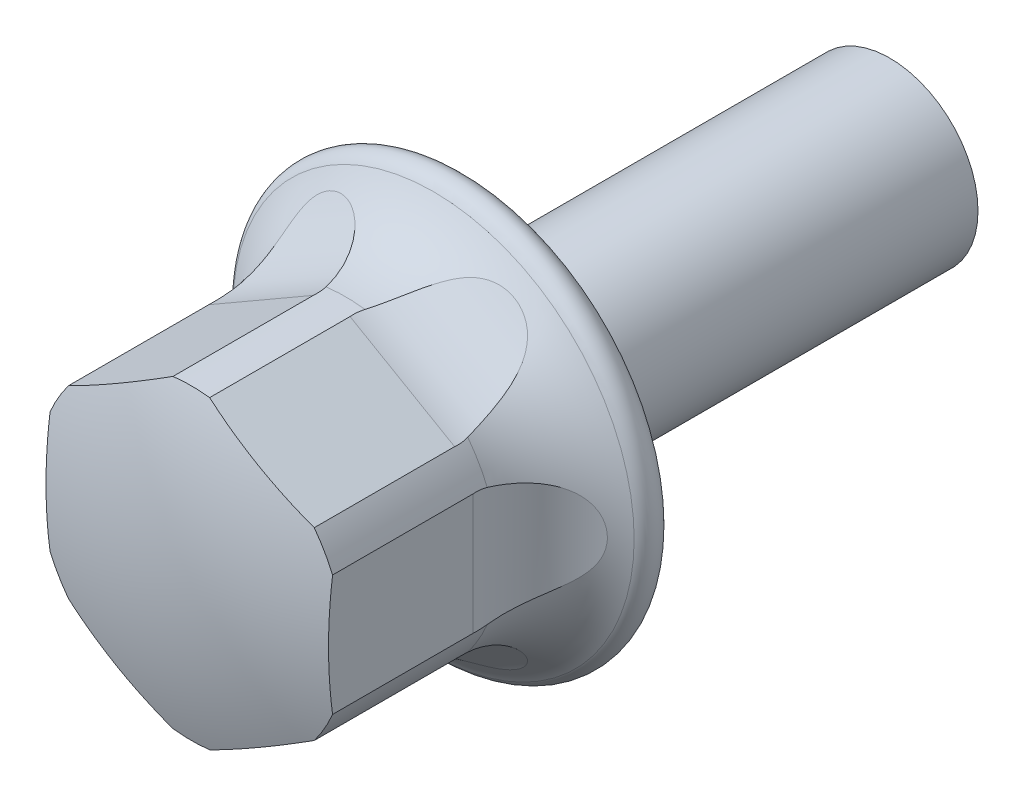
ISO-10303-21;
HEADER;
FILE_DESCRIPTION(('STEP AP214'),'2;1');
FILE_NAME('part.step','',(''),(''),'','','');
FILE_SCHEMA(('AUTOMOTIVE_DESIGN { 1 0 10303 214 1 1 1 1 }'));
ENDSEC;
DATA;
#1=APPLICATION_CONTEXT('core data for automotive mechanical design processes');
#2=APPLICATION_PROTOCOL_DEFINITION('international standard','automotive_design',2000,#1);
#3=PRODUCT_CONTEXT('',#1,'mechanical');
#4=PRODUCT('Part','Part','',(#3));
#5=PRODUCT_RELATED_PRODUCT_CATEGORY('part','',(#4));
#6=PRODUCT_DEFINITION_FORMATION('','',#4);
#7=PRODUCT_DEFINITION_CONTEXT('part definition',#1,'design');
#8=PRODUCT_DEFINITION('design','',#6,#7);
#9=PRODUCT_DEFINITION_SHAPE('','',#8);
#10=(LENGTH_UNIT() NAMED_UNIT(*) SI_UNIT(.MILLI.,.METRE.));
#11=(NAMED_UNIT(*) PLANE_ANGLE_UNIT() SI_UNIT($,.RADIAN.));
#12=(NAMED_UNIT(*) SI_UNIT($,.STERADIAN.) SOLID_ANGLE_UNIT());
#13=UNCERTAINTY_MEASURE_WITH_UNIT(LENGTH_MEASURE(1.E-05),#10,'distance_accuracy_value','');
#14=(GEOMETRIC_REPRESENTATION_CONTEXT(3) GLOBAL_UNCERTAINTY_ASSIGNED_CONTEXT((#13)) GLOBAL_UNIT_ASSIGNED_CONTEXT((#10,
#11,#12)) REPRESENTATION_CONTEXT('',''));
#15=CARTESIAN_POINT('',(0.,0.,0.));
#16=DIRECTION('',(0.,0.,1.));
#17=DIRECTION('',(1.,0.,0.));
#18=AXIS2_PLACEMENT_3D('',#15,#16,#17);
#19=CARTESIAN_POINT('',(0.,0.,0.));
#20=DIRECTION('',(0.,0.,1.));
#21=DIRECTION('',(1.,0.,0.));
#22=AXIS2_PLACEMENT_3D('',#19,#20,#21);
#23=CYLINDRICAL_SURFACE('',#22,4.35);
#24=CARTESIAN_POINT('',(0.,0.,3.40730115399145));
#25=DIRECTION('',(0.,0.,1.));
#26=DIRECTION('',(1.,0.,0.));
#27=AXIS2_PLACEMENT_3D('',#24,#25,#26);
#28=CIRCLE('',#27,4.35);
#29=CARTESIAN_POINT('',(4.01264578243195,1.67963502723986,3.40730115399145));
#30=VERTEX_POINT('',#29);
#31=CARTESIAN_POINT('',(3.46092949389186,2.63523567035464,3.40730115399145));
#32=VERTEX_POINT('',#31);
#33=EDGE_CURVE('E281',#30,#32,#28,.T.);
#34=ORIENTED_EDGE('',*,*,#33,.T.);
#35=CARTESIAN_POINT('',(3.46092949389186,2.63523567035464,3.40730115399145));
#36=CARTESIAN_POINT('',(3.46595952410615,2.62862639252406,3.4400081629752));
#37=CARTESIAN_POINT('',(3.47013721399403,2.62310412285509,3.47305115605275));
#38=CARTESIAN_POINT('',(3.47677513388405,2.61430065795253,3.53960450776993));
#39=CARTESIAN_POINT('',(3.47923536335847,2.61101946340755,3.57311486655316));
#40=CARTESIAN_POINT('',(3.48401109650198,2.60465087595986,3.67383775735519));
#41=CARTESIAN_POINT('',(3.48375201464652,2.60499797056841,3.7414412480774));
#42=CARTESIAN_POINT('',(3.4763397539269,2.61487966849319,3.87559793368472));
#43=CARTESIAN_POINT('',(3.46918166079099,2.62442082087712,3.94215034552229));
#44=CARTESIAN_POINT('',(3.44808593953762,2.65207507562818,4.07232125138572));
#45=CARTESIAN_POINT('',(3.43414868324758,2.67018770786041,4.13593990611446));
#46=CARTESIAN_POINT('',(3.39959155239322,2.71404801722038,4.25913196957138));
#47=CARTESIAN_POINT('',(3.3789204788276,2.73985405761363,4.31867001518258));
#48=CARTESIAN_POINT('',(3.33128003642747,2.79758298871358,4.43197183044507));
#49=CARTESIAN_POINT('',(3.3043080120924,2.82950845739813,4.48573315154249));
#50=CARTESIAN_POINT('',(3.24184756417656,2.90092453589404,4.59122812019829));
#51=CARTESIAN_POINT('',(3.20581363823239,2.94083616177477,4.64235173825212));
#52=CARTESIAN_POINT('',(3.1274973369,3.02399175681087,4.73641163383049));
#53=CARTESIAN_POINT('',(3.08521238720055,3.06723709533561,4.77934452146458));
#54=CARTESIAN_POINT('',(2.98843361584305,3.1618003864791,4.86276449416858));
#55=CARTESIAN_POINT('',(2.93305912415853,3.21336533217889,4.90194757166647));
#56=CARTESIAN_POINT('',(2.81611394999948,3.31633672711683,4.96985720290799));
#57=CARTESIAN_POINT('',(2.75453931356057,3.36774305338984,4.99857702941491));
#58=CARTESIAN_POINT('',(2.61530358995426,3.4773263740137,5.05007630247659));
#59=CARTESIAN_POINT('',(2.53668962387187,3.53516365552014,5.07100843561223));
#60=CARTESIAN_POINT('',(2.3740786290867,3.6463650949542,5.099809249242));
#61=CARTESIAN_POINT('',(2.29007830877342,3.69972647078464,5.10766986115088));
#62=CARTESIAN_POINT('',(2.10775203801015,3.806886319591,5.1107626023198));
#63=CARTESIAN_POINT('',(2.00894116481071,3.85991877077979,5.10430823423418));
#64=CARTESIAN_POINT('',(1.80941884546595,3.9573778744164,5.0749193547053));
#65=CARTESIAN_POINT('',(1.70870602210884,4.00179800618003,5.05197241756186));
#66=CARTESIAN_POINT('',(1.50808653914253,4.08165709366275,4.98842483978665));
#67=CARTESIAN_POINT('',(1.40819508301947,4.11701240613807,4.9476685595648));
#68=CARTESIAN_POINT('',(1.21516064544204,4.17804666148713,4.84736433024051));
#69=CARTESIAN_POINT('',(1.12200244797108,4.20374801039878,4.78786049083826));
#70=CARTESIAN_POINT('',(0.974973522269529,4.23979268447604,4.6706888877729));
#71=CARTESIAN_POINT('',(0.917744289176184,4.2524299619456,4.61791347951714));
#72=CARTESIAN_POINT('',(0.812080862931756,4.27386495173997,4.50348001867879));
#73=CARTESIAN_POINT('',(0.763641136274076,4.28266508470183,4.44182759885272));
#74=CARTESIAN_POINT('',(0.677807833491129,4.29709162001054,4.31032974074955));
#75=CARTESIAN_POINT('',(0.640483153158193,4.30269841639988,4.24043680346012));
#76=CARTESIAN_POINT('',(0.579556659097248,4.31133100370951,4.09470676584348));
#77=CARTESIAN_POINT('',(0.55595198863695,4.31435733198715,4.01887090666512));
#78=CARTESIAN_POINT('',(0.525760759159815,4.31813368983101,3.87248275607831));
#79=CARTESIAN_POINT('',(0.517598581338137,4.31909602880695,3.80225659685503));
#80=CARTESIAN_POINT('',(0.513845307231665,4.31954526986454,3.66152613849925));
#81=CARTESIAN_POINT('',(0.51823106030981,4.31903488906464,3.59102259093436));
#82=CARTESIAN_POINT('',(0.531636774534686,4.31739123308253,3.50233355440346));
#83=CARTESIAN_POINT('',(0.535014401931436,4.31697500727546,3.48317292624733));
#84=CARTESIAN_POINT('',(0.542684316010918,4.31601783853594,3.4450731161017));
#85=CARTESIAN_POINT('',(0.54697501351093,4.31547711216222,3.4261336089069));
#86=CARTESIAN_POINT('',(0.551716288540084,4.31487069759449,3.40730115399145));
#87=B_SPLINE_CURVE_WITH_KNOTS('',3,(#35,#36,#37,#38,#39,#40,#41,#42,#43,#44,#45,#46,#47,#48,#49,
#50,#51,#52,#53,#54,#55,#56,#57,#58,#59,#60,#61,#62,#63,#64,#65,#66,#67,#68,#69,#70,#71,#72,#73,
#74,#75,#76,#77,#78,#79,#80,#81,#82,#83,#84,#85,#86),.UNSPECIFIED.,.F.,.F.,(4,2,2,2,2,2,2,2,2,2,
2,2,2,2,2,2,2,2,2,2,2,2,2,2,2,4),(0.,0.101175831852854,0.202351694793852,0.40409501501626,
0.605982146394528,0.80785820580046,1.01130647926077,1.21484065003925,1.43655460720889,
1.65836012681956,1.91301666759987,2.1678366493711,2.46609673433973,2.76454085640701,
3.09998592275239,3.43568398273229,3.77437635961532,4.11227773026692,4.34793629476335,
4.5834459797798,4.82038644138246,5.05727755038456,5.26832574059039,5.47898480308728,
5.53735193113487,5.59561829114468),.UNSPECIFIED.);
#88=CARTESIAN_POINT('',(3.48049822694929,2.60933556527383,3.8));
#89=VERTEX_POINT('',#88);
#90=EDGE_CURVE('E312',#32,#89,#87,.T.);
#91=ORIENTED_EDGE('',*,*,#90,.T.);
#92=DIRECTION('',(0.,0.,1.));
#93=VECTOR('',#92,1.);
#94=CARTESIAN_POINT('',(3.48049822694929,2.60933556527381,0.));
#95=LINE('',#94,#93);
#96=CARTESIAN_POINT('',(3.48049822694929,2.60933556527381,7.77399857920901));
#97=VERTEX_POINT('',#96);
#98=EDGE_CURVE('E181',#97,#89,#95,.F.);
#99=ORIENTED_EDGE('',*,*,#98,.F.);
#100=CARTESIAN_POINT('',(0.,0.,7.77399857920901));
#101=DIRECTION('',(0.,0.,1.));
#102=DIRECTION('',(1.,0.,0.));
#103=AXIS2_PLACEMENT_3D('',#100,#101,#102);
#104=CIRCLE('',#103,4.35);
#105=CARTESIAN_POINT('',(4.,1.70953209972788,7.77399857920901));
#106=VERTEX_POINT('',#105);
#107=EDGE_CURVE('E265',#106,#97,#104,.T.);
#108=ORIENTED_EDGE('',*,*,#107,.F.);
#109=DIRECTION('',(0.,0.,1.));
#110=VECTOR('',#109,1.);
#111=CARTESIAN_POINT('',(4.,1.70953209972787,0.));
#112=LINE('',#111,#110);
#113=CARTESIAN_POINT('',(4.,1.70953209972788,3.8));
#114=VERTEX_POINT('',#113);
#115=EDGE_CURVE('E32',#114,#106,#112,.T.);
#116=ORIENTED_EDGE('',*,*,#115,.F.);
#117=CARTESIAN_POINT('',(4.01264578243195,-1.67963502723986,3.40730115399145));
#118=CARTESIAN_POINT('',(4.00943699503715,-1.68729580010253,3.4400081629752));
#119=CARTESIAN_POINT('',(4.00674341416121,-1.69367492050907,3.47305115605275));
#120=CARTESIAN_POINT('',(4.00243834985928,-1.70382526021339,3.53960450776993));
#121=CARTESIAN_POINT('',(4.00082686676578,-1.70759647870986,3.57311486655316));
#122=CARTESIAN_POINT('',(3.99769937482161,-1.71491667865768,3.67383775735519));
#123=CARTESIAN_POINT('',(3.99787042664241,-1.71451875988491,3.7414412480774));
#124=CARTESIAN_POINT('',(4.00272209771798,-1.70315870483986,3.87559793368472));
#125=CARTESIAN_POINT('',(4.00740593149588,-1.69218903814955,3.9421503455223));
#126=CARTESIAN_POINT('',(4.02080735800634,-1.66009248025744,4.07232125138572));
#127=CARTESIAN_POINT('',(4.02952472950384,-1.63896614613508,4.13593990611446));
#128=CARTESIAN_POINT('',(4.05023030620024,-1.58710863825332,4.25913196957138));
#129=CARTESIAN_POINT('',(4.06224345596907,-1.55630394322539,4.31867001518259));
#130=CARTESIAN_POINT('',(4.08841795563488,-1.48618164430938,4.43197183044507));
#131=CARTESIAN_POINT('',(4.10258021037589,-1.44686045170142,4.48573315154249));
#132=CARTESIAN_POINT('',(4.1331981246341,-1.35706007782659,4.59122812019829));
#133=CARTESIAN_POINT('',(4.14974564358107,-1.3058979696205,4.64235173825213));
#134=CARTESIAN_POINT('',(4.18260235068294,-1.19649626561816,4.7364116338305));
#135=CARTESIAN_POINT('',(4.1989114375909,-1.13825375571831,4.77934452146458));
#136=CARTESIAN_POINT('',(4.23241626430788,-1.00715923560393,4.86276449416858));
#137=CARTESIAN_POINT('',(4.24938557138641,-0.933421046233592,4.90194757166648));
#138=CARTESIAN_POINT('',(4.28008882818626,-0.780657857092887,4.969857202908));
#139=CARTESIAN_POINT('',(4.29382069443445,-0.701629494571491,4.99857702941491));
#140=CARTESIAN_POINT('',(4.31910477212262,-0.526256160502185,5.05007630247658));
#141=CARTESIAN_POINT('',(4.32988634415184,-0.42925582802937,5.07100843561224));
#142=CARTESIAN_POINT('',(4.34488411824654,-0.232829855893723,5.09980924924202));
#143=CARTESIAN_POINT('',(4.34909626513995,-0.13340275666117,5.10766986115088));
#144=CARTESIAN_POINT('',(4.35073628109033,0.0780763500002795,5.1107626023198));
#145=CARTESIAN_POINT('',(4.34725829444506,0.190165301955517,5.1043082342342));
#146=CARTESIAN_POINT('',(4.33189919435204,0.411686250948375,5.07491935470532));
#147=CARTESIAN_POINT('',(4.32001174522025,0.52111618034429,5.05197241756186));
#148=CARTESIAN_POINT('',(4.28886200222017,0.734787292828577,4.98842483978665));
#149=CARTESIAN_POINT('',(4.269534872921,0.838973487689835,4.94766855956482));
#150=CARTESIAN_POINT('',(4.22587486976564,1.03666334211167,4.84736433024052));
#151=CARTESIAN_POINT('',(4.20155379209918,1.13019138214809,4.78786049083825));
#152=CARTESIAN_POINT('',(4.15925493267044,1.27554450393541,4.67068888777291));
#153=CARTESIAN_POINT('',(4.14158451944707,1.33142511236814,4.61791347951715));
#154=CARTESIAN_POINT('',(4.10731605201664,1.4336498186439,4.50348001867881));
#155=CARTESIAN_POINT('',(4.09071732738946,1.47999991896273,4.44182759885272));
#156=CARTESIAN_POINT('',(4.06029442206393,1.56154700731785,4.31032974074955));
#157=CARTESIAN_POINT('',(4.04648771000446,1.596674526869,4.24043680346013));
#158=CARTESIAN_POINT('',(4.02350050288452,1.65375471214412,4.09470676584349));
#159=CARTESIAN_POINT('',(4.014319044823,1.67571012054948,4.01887090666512));
#160=CARTESIAN_POINT('',(4.00249385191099,1.7037446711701,3.87248275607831));
#161=CARTESIAN_POINT('',(3.99924617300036,1.71129449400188,3.80225659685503));
#162=CARTESIAN_POINT('',(3.99775859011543,1.71476954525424,3.66152613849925));
#163=CARTESIAN_POINT('',(3.9995094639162,1.71071618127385,3.59102259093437));
#164=CARTESIAN_POINT('',(4.00478887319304,1.69828466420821,3.50233355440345));
#165=CARTESIAN_POINT('',(4.00611722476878,1.69515144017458,3.48317292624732));
#166=CARTESIAN_POINT('',(4.00912324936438,1.68803051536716,3.44507311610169));
#167=CARTESIAN_POINT('',(4.01080031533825,1.68404429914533,3.42613360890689));
#168=CARTESIAN_POINT('',(4.01264578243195,1.67963502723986,3.40730115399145));
#169=B_SPLINE_CURVE_WITH_KNOTS('',3,(#117,#118,#119,#120,#121,#122,#123,#124,#125,#126,#127,
#128,#129,#130,#131,#132,#133,#134,#135,#136,#137,#138,#139,#140,#141,#142,#143,#144,#145,#146,
#147,#148,#149,#150,#151,#152,#153,#154,#155,#156,#157,#158,#159,#160,#161,#162,#163,#164,#165,
#166,#167,#168),.UNSPECIFIED.,.F.,.F.,(4,2,2,2,2,2,2,2,2,2,2,2,2,2,2,2,2,2,2,2,2,2,2,2,2,4),(0.,
0.101175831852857,0.202351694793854,0.404095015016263,0.605982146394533,0.807858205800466,
1.01130647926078,1.21484065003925,1.4365546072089,1.65836012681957,1.91301666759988,
2.16783664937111,2.46609673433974,2.76454085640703,3.0999859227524,3.43568398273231,
3.77437635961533,4.11227773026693,4.34793629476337,4.58344597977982,4.82038644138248,
5.05727755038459,5.26832574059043,5.47898480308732,5.5373519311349,5.59561829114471),.UNSPECIFIED.);
#170=EDGE_CURVE('E357',#114,#30,#169,.T.);
#171=ORIENTED_EDGE('',*,*,#170,.T.);
#172=EDGE_LOOP('',(#34,#91,#99,#108,#116,#171));
#173=FACE_BOUND('',#172,.T.);
#174=ADVANCED_FACE('F16',(#173),#23,.T.);
#175=CARTESIAN_POINT('',(-0.551716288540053,-4.3148706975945,3.40730115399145));
#176=VERTEX_POINT('',#175);
#177=CARTESIAN_POINT('',(0.551716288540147,-4.31487069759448,3.40730115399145));
#178=VERTEX_POINT('',#177);
#179=EDGE_CURVE('E164',#176,#178,#28,.T.);
#180=ORIENTED_EDGE('',*,*,#179,.T.);
#181=CARTESIAN_POINT('',(0.551716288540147,-4.31487069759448,3.40730115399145));
#182=CARTESIAN_POINT('',(0.543477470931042,-4.31592219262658,3.4400081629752));
#183=CARTESIAN_POINT('',(0.536606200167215,-4.31677904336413,3.47305115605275));
#184=CARTESIAN_POINT('',(0.525663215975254,-4.31812591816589,3.53960450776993));
#185=CARTESIAN_POINT('',(0.521591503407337,-4.31861594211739,3.57311486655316));
#186=CARTESIAN_POINT('',(0.513688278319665,-4.31956755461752,3.67383775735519));
#187=CARTESIAN_POINT('',(0.514118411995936,-4.3195167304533,3.7414412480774));
#188=CARTESIAN_POINT('',(0.526382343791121,-4.31803837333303,3.87559793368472));
#189=CARTESIAN_POINT('',(0.538224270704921,-4.31660985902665,3.9421503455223));
#190=CARTESIAN_POINT('',(0.572721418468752,-4.3121675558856,4.07232125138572));
#191=CARTESIAN_POINT('',(0.595376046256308,-4.30915385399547,4.13593990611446));
#192=CARTESIAN_POINT('',(0.650638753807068,-4.30115665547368,4.25913196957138));
#193=CARTESIAN_POINT('',(0.683322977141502,-4.29615800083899,4.3186700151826));
#194=CARTESIAN_POINT('',(0.75713791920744,-4.28376463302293,4.43197183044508));
#195=CARTESIAN_POINT('',(0.798272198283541,-4.27636890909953,4.48573315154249));
#196=CARTESIAN_POINT('',(0.891350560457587,-4.25798461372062,4.59122812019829));
#197=CARTESIAN_POINT('',(0.943932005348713,-4.24673413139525,4.64235173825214));
#198=CARTESIAN_POINT('',(1.05510501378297,-4.22048802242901,4.7364116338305));
#199=CARTESIAN_POINT('',(1.1136990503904,-4.2054908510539,4.77934452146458));
#200=CARTESIAN_POINT('',(1.24398264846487,-4.168959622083,4.86276449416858));
#201=CARTESIAN_POINT('',(1.31632644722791,-4.14678637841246,4.90194757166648));
#202=CARTESIAN_POINT('',(1.46397487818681,-4.09699458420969,4.969857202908));
#203=CARTESIAN_POINT('',(1.53928138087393,-4.0693725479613,4.99857702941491));
#204=CARTESIAN_POINT('',(1.70380118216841,-4.00358253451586,5.05007630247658));
#205=CARTESIAN_POINT('',(1.79319672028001,-3.96441948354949,5.07100843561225));
#206=CARTESIAN_POINT('',(1.97080548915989,-3.87919495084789,5.09980924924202));
#207=CARTESIAN_POINT('',(2.05901795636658,-3.83312922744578,5.10766986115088));
#208=CARTESIAN_POINT('',(2.24298424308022,-3.72880996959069,5.1107626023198));
#209=CARTESIAN_POINT('',(2.33831712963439,-3.66975346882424,5.1043082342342));
#210=CARTESIAN_POINT('',(2.52248034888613,-3.545691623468,5.07491935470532));
#211=CARTESIAN_POINT('',(2.61130572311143,-3.48068182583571,5.05197241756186));
#212=CARTESIAN_POINT('',(2.78077546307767,-3.34686980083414,4.98842483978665));
#213=CARTESIAN_POINT('',(2.86133978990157,-3.2780389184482,4.94766855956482));
#214=CARTESIAN_POINT('',(3.01071422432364,-3.14138331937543,4.84736433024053));
#215=CARTESIAN_POINT('',(3.07955134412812,-3.07355662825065,4.78786049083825));
#216=CARTESIAN_POINT('',(3.18428141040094,-2.96424818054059,4.67068888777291));
#217=CARTESIAN_POINT('',(3.22384023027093,-2.92100484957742,4.61791347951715));
#218=CARTESIAN_POINT('',(3.29523518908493,-2.84021513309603,4.50348001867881));
#219=CARTESIAN_POINT('',(3.3270761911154,-2.80266516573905,4.44182759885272));
#220=CARTESIAN_POINT('',(3.38248658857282,-2.73554461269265,4.31032974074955));
#221=CARTESIAN_POINT('',(3.40600455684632,-2.70602388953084,4.24043680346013));
#222=CARTESIAN_POINT('',(3.44394384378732,-2.65757629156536,4.09470676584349));
#223=CARTESIAN_POINT('',(3.45836705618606,-2.63864721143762,4.01887090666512));
#224=CARTESIAN_POINT('',(3.4767330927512,-2.61438901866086,3.87248275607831));
#225=CARTESIAN_POINT('',(3.48164759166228,-2.60780153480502,3.80225659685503));
#226=CARTESIAN_POINT('',(3.4839132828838,-2.60477572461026,3.66152613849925));
#227=CARTESIAN_POINT('',(3.48127840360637,-2.60831870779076,3.59102259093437));
#228=CARTESIAN_POINT('',(3.47315209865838,-2.61910656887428,3.50233355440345));
#229=CARTESIAN_POINT('',(3.47110282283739,-2.62182356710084,3.48317292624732));
#230=CARTESIAN_POINT('',(3.46643893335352,-2.62798732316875,3.44507311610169));
#231=CARTESIAN_POINT('',(3.46382530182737,-2.63143281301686,3.42613360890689));
#232=CARTESIAN_POINT('',(3.46092949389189,-2.63523567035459,3.40730115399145));
#233=B_SPLINE_CURVE_WITH_KNOTS('',3,(#181,#182,#183,#184,#185,#186,#187,#188,#189,#190,#191,
#192,#193,#194,#195,#196,#197,#198,#199,#200,#201,#202,#203,#204,#205,#206,#207,#208,#209,#210,
#211,#212,#213,#214,#215,#216,#217,#218,#219,#220,#221,#222,#223,#224,#225,#226,#227,#228,#229,
#230,#231,#232),.UNSPECIFIED.,.F.,.F.,(4,2,2,2,2,2,2,2,2,2,2,2,2,2,2,2,2,2,2,2,2,2,2,2,2,4),(0.,
0.101175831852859,0.202351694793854,0.404095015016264,0.605982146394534,0.807858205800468,
1.01130647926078,1.21484065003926,1.4365546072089,1.65836012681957,1.91301666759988,
2.16783664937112,2.46609673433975,2.76454085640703,3.09998592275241,3.43568398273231,
3.77437635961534,4.11227773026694,4.34793629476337,4.58344597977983,4.82038644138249,
5.05727755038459,5.26832574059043,5.47898480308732,5.53735193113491,5.59561829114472),.UNSPECIFIED.);
#234=CARTESIAN_POINT('',(0.519501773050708,-4.31886766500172,3.8));
#235=VERTEX_POINT('',#234);
#236=EDGE_CURVE('E144',#178,#235,#233,.T.);
#237=ORIENTED_EDGE('',*,*,#236,.T.);
#238=DIRECTION('',(0.,0.,1.));
#239=VECTOR('',#238,1.);
#240=CARTESIAN_POINT('',(0.519501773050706,-4.31886766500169,0.));
#241=LINE('',#240,#239);
#242=CARTESIAN_POINT('',(0.519501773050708,-4.31886766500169,7.77399857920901));
#243=VERTEX_POINT('',#242);
#244=EDGE_CURVE('E160',#243,#235,#241,.F.);
#245=ORIENTED_EDGE('',*,*,#244,.F.);
#246=CARTESIAN_POINT('',(-0.519501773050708,-4.31886766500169,7.77399857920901));
#247=VERTEX_POINT('',#246);
#248=EDGE_CURVE('E495',#247,#243,#104,.T.);
#249=ORIENTED_EDGE('',*,*,#248,.F.);
#250=DIRECTION('',(0.,0.,1.));
#251=VECTOR('',#250,1.);
#252=CARTESIAN_POINT('',(-0.519501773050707,-4.31886766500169,0.));
#253=LINE('',#252,#251);
#254=CARTESIAN_POINT('',(-0.519501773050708,-4.31886766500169,3.8));
#255=VERTEX_POINT('',#254);
#256=EDGE_CURVE('E299',#255,#247,#253,.T.);
#257=ORIENTED_EDGE('',*,*,#256,.F.);
#258=CARTESIAN_POINT('',(-3.46092949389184,-2.63523567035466,3.40730115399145));
#259=CARTESIAN_POINT('',(-3.46595952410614,-2.62862639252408,3.4400081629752));
#260=CARTESIAN_POINT('',(-3.47013721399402,-2.6231041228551,3.47305115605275));
#261=CARTESIAN_POINT('',(-3.47677513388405,-2.61430065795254,3.53960450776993));
#262=CARTESIAN_POINT('',(-3.47923536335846,-2.61101946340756,3.57311486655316));
#263=CARTESIAN_POINT('',(-3.48401109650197,-2.60465087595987,3.67383775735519));
#264=CARTESIAN_POINT('',(-3.4837520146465,-2.60499797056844,3.7414412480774));
#265=CARTESIAN_POINT('',(-3.47633975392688,-2.61487966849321,3.87559793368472));
#266=CARTESIAN_POINT('',(-3.46918166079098,-2.62442082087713,3.9421503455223));
#267=CARTESIAN_POINT('',(-3.44808593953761,-2.65207507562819,4.07232125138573));
#268=CARTESIAN_POINT('',(-3.43414868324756,-2.67018770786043,4.13593990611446));
#269=CARTESIAN_POINT('',(-3.3995915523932,-2.7140480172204,4.25913196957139));
#270=CARTESIAN_POINT('',(-3.37892047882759,-2.73985405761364,4.3186700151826));
#271=CARTESIAN_POINT('',(-3.33128003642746,-2.79758298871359,4.43197183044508));
#272=CARTESIAN_POINT('',(-3.30430801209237,-2.82950845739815,4.48573315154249));
#273=CARTESIAN_POINT('',(-3.24184756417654,-2.90092453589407,4.59122812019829));
#274=CARTESIAN_POINT('',(-3.20581363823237,-2.94083616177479,4.64235173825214));
#275=CARTESIAN_POINT('',(-3.12749733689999,-3.02399175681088,4.7364116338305));
#276=CARTESIAN_POINT('',(-3.08521238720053,-3.06723709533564,4.77934452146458));
#277=CARTESIAN_POINT('',(-2.98843361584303,-3.16180038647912,4.86276449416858));
#278=CARTESIAN_POINT('',(-2.93305912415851,-3.21336533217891,4.90194757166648));
#279=CARTESIAN_POINT('',(-2.81611394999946,-3.31633672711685,4.969857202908));
#280=CARTESIAN_POINT('',(-2.75453931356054,-3.36774305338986,4.99857702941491));
#281=CARTESIAN_POINT('',(-2.61530358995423,-3.47732637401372,5.05007630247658));
#282=CARTESIAN_POINT('',(-2.53668962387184,-3.53516365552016,5.07100843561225));
#283=CARTESIAN_POINT('',(-2.37407862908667,-3.64636509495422,5.09980924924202));
#284=CARTESIAN_POINT('',(-2.29007830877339,-3.69972647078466,5.10766986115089));
#285=CARTESIAN_POINT('',(-2.10775203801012,-3.80688631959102,5.1107626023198));
#286=CARTESIAN_POINT('',(-2.00894116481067,-3.85991877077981,5.1043082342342));
#287=CARTESIAN_POINT('',(-1.80941884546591,-3.95737787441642,5.07491935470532));
#288=CARTESIAN_POINT('',(-1.70870602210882,-4.00179800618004,5.05197241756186));
#289=CARTESIAN_POINT('',(-1.5080865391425,-4.08165709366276,4.98842483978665));
#290=CARTESIAN_POINT('',(-1.40819508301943,-4.11701240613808,4.94766855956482));
#291=CARTESIAN_POINT('',(-1.215160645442,-4.17804666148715,4.84736433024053));
#292=CARTESIAN_POINT('',(-1.12200244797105,-4.20374801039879,4.78786049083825));
#293=CARTESIAN_POINT('',(-0.974973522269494,-4.23979268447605,4.67068888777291));
#294=CARTESIAN_POINT('',(-0.917744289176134,-4.25242996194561,4.61791347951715));
#295=CARTESIAN_POINT('',(-0.812080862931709,-4.27386495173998,4.5034800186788));
#296=CARTESIAN_POINT('',(-0.763641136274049,-4.28266508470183,4.44182759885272));
#297=CARTESIAN_POINT('',(-0.677807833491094,-4.29709162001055,4.31032974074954));
#298=CARTESIAN_POINT('',(-0.640483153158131,-4.30269841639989,4.24043680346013));
#299=CARTESIAN_POINT('',(-0.579556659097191,-4.31133100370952,4.09470676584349));
#300=CARTESIAN_POINT('',(-0.555951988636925,-4.31435733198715,4.01887090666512));
#301=CARTESIAN_POINT('',(-0.52576075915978,-4.31813368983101,3.87248275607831));
#302=CARTESIAN_POINT('',(-0.517598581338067,-4.31909602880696,3.80225659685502));
#303=CARTESIAN_POINT('',(-0.513845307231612,-4.31954526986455,3.66152613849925));
#304=CARTESIAN_POINT('',(-0.51823106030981,-4.31903488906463,3.59102259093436));
#305=CARTESIAN_POINT('',(-0.531636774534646,-4.31739123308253,3.50233355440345));
#306=CARTESIAN_POINT('',(-0.535014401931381,-4.31697500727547,3.48317292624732));
#307=CARTESIAN_POINT('',(-0.542684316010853,-4.31601783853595,3.44507311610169));
#308=CARTESIAN_POINT('',(-0.54697501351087,-4.31547711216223,3.42613360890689));
#309=CARTESIAN_POINT('',(-0.551716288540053,-4.3148706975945,3.40730115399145));
#310=B_SPLINE_CURVE_WITH_KNOTS('',3,(#258,#259,#260,#261,#262,#263,#264,#265,#266,#267,#268,
#269,#270,#271,#272,#273,#274,#275,#276,#277,#278,#279,#280,#281,#282,#283,#284,#285,#286,#287,
#288,#289,#290,#291,#292,#293,#294,#295,#296,#297,#298,#299,#300,#301,#302,#303,#304,#305,#306,
#307,#308,#309),.UNSPECIFIED.,.F.,.F.,(4,2,2,2,2,2,2,2,2,2,2,2,2,2,2,2,2,2,2,2,2,2,2,2,2,4),(0.,
0.101175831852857,0.202351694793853,0.404095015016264,0.605982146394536,0.80785820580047,
1.01130647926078,1.21484065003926,1.4365546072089,1.65836012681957,1.91301666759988,
2.16783664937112,2.46609673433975,2.76454085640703,3.09998592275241,3.43568398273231,
3.77437635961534,4.11227773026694,4.34793629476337,4.58344597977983,4.82038644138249,
5.0572775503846,5.26832574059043,5.47898480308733,5.53735193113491,5.59561829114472),.UNSPECIFIED.);
#311=EDGE_CURVE('E399',#255,#176,#310,.T.);
#312=ORIENTED_EDGE('',*,*,#311,.T.);
#313=EDGE_LOOP('',(#180,#237,#245,#249,#257,#312));
#314=FACE_BOUND('',#313,.T.);
#315=ADVANCED_FACE('F158',(#314),#23,.T.);
#316=CARTESIAN_POINT('',(-4.01264578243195,-1.67963502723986,3.40730115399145));
#317=VERTEX_POINT('',#316);
#318=CARTESIAN_POINT('',(-3.46092949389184,-2.63523567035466,3.40730115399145));
#319=VERTEX_POINT('',#318);
#320=EDGE_CURVE('E440',#317,#319,#28,.T.);
#321=ORIENTED_EDGE('',*,*,#320,.T.);
#322=CARTESIAN_POINT('',(-3.48049822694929,-2.60933556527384,3.8));
#323=VERTEX_POINT('',#322);
#324=EDGE_CURVE('E398',#319,#323,#310,.T.);
#325=ORIENTED_EDGE('',*,*,#324,.T.);
#326=DIRECTION('',(0.,0.,1.));
#327=VECTOR('',#326,1.);
#328=CARTESIAN_POINT('',(-3.48049822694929,-2.60933556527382,0.));
#329=LINE('',#328,#327);
#330=CARTESIAN_POINT('',(-3.48049822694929,-2.60933556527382,7.77399857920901));
#331=VERTEX_POINT('',#330);
#332=EDGE_CURVE('E295',#331,#323,#329,.F.);
#333=ORIENTED_EDGE('',*,*,#332,.F.);
#334=CARTESIAN_POINT('',(-4.,-1.70953209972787,7.77399857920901));
#335=VERTEX_POINT('',#334);
#336=EDGE_CURVE('E496',#335,#331,#104,.T.);
#337=ORIENTED_EDGE('',*,*,#336,.F.);
#338=DIRECTION('',(0.,0.,1.));
#339=VECTOR('',#338,1.);
#340=CARTESIAN_POINT('',(-4.,-1.70953209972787,0.));
#341=LINE('',#340,#339);
#342=CARTESIAN_POINT('',(-4.,-1.70953209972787,3.8));
#343=VERTEX_POINT('',#342);
#344=EDGE_CURVE('E306',#343,#335,#341,.T.);
#345=ORIENTED_EDGE('',*,*,#344,.F.);
#346=CARTESIAN_POINT('',(-4.01264578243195,1.67963502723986,3.40730115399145));
#347=CARTESIAN_POINT('',(-4.00943699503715,1.68729580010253,3.4400081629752));
#348=CARTESIAN_POINT('',(-4.00674341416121,1.69367492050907,3.47305115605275));
#349=CARTESIAN_POINT('',(-4.00243834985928,1.70382526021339,3.53960450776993));
#350=CARTESIAN_POINT('',(-4.00082686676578,1.70759647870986,3.57311486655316));
#351=CARTESIAN_POINT('',(-3.99769937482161,1.71491667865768,3.67383775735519));
#352=CARTESIAN_POINT('',(-3.99787042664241,1.71451875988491,3.7414412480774));
#353=CARTESIAN_POINT('',(-4.00272209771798,1.70315870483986,3.87559793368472));
#354=CARTESIAN_POINT('',(-4.00740593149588,1.69218903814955,3.9421503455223));
#355=CARTESIAN_POINT('',(-4.02080735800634,1.66009248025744,4.07232125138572));
#356=CARTESIAN_POINT('',(-4.02952472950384,1.63896614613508,4.13593990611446));
#357=CARTESIAN_POINT('',(-4.05023030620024,1.58710863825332,4.25913196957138));
#358=CARTESIAN_POINT('',(-4.06224345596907,1.55630394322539,4.31867001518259));
#359=CARTESIAN_POINT('',(-4.08841795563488,1.48618164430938,4.43197183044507));
#360=CARTESIAN_POINT('',(-4.10258021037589,1.44686045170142,4.48573315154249));
#361=CARTESIAN_POINT('',(-4.1331981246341,1.35706007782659,4.59122812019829));
#362=CARTESIAN_POINT('',(-4.14974564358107,1.3058979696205,4.64235173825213));
#363=CARTESIAN_POINT('',(-4.18260235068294,1.19649626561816,4.7364116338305));
#364=CARTESIAN_POINT('',(-4.1989114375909,1.13825375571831,4.77934452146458));
#365=CARTESIAN_POINT('',(-4.23241626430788,1.00715923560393,4.86276449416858));
#366=CARTESIAN_POINT('',(-4.24938557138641,0.933421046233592,4.90194757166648));
#367=CARTESIAN_POINT('',(-4.28008882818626,0.780657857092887,4.969857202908));
#368=CARTESIAN_POINT('',(-4.29382069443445,0.701629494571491,4.99857702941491));
#369=CARTESIAN_POINT('',(-4.31910477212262,0.526256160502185,5.05007630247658));
#370=CARTESIAN_POINT('',(-4.32988634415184,0.429255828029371,5.07100843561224));
#371=CARTESIAN_POINT('',(-4.34488411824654,0.232829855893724,5.09980924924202));
#372=CARTESIAN_POINT('',(-4.34909626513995,0.133402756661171,5.10766986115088));
#373=CARTESIAN_POINT('',(-4.35073628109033,-0.0780763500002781,5.1107626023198));
#374=CARTESIAN_POINT('',(-4.34725829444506,-0.190165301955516,5.1043082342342));
#375=CARTESIAN_POINT('',(-4.33189919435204,-0.411686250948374,5.07491935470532));
#376=CARTESIAN_POINT('',(-4.32001174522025,-0.521116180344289,5.05197241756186));
#377=CARTESIAN_POINT('',(-4.28886200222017,-0.734787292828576,4.98842483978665));
#378=CARTESIAN_POINT('',(-4.269534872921,-0.838973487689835,4.94766855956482));
#379=CARTESIAN_POINT('',(-4.22587486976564,-1.03666334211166,4.84736433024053));
#380=CARTESIAN_POINT('',(-4.20155379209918,-1.13019138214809,4.78786049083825));
#381=CARTESIAN_POINT('',(-4.15925493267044,-1.27554450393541,4.67068888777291));
#382=CARTESIAN_POINT('',(-4.14158451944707,-1.33142511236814,4.61791347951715));
#383=CARTESIAN_POINT('',(-4.10731605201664,-1.4336498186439,4.50348001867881));
#384=CARTESIAN_POINT('',(-4.09071732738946,-1.47999991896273,4.44182759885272));
#385=CARTESIAN_POINT('',(-4.06029442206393,-1.56154700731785,4.31032974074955));
#386=CARTESIAN_POINT('',(-4.04648771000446,-1.596674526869,4.24043680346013));
#387=CARTESIAN_POINT('',(-4.02350050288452,-1.65375471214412,4.09470676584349));
#388=CARTESIAN_POINT('',(-4.014319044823,-1.67571012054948,4.01887090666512));
#389=CARTESIAN_POINT('',(-4.00249385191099,-1.7037446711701,3.87248275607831));
#390=CARTESIAN_POINT('',(-3.99924617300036,-1.71129449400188,3.80225659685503));
#391=CARTESIAN_POINT('',(-3.99775859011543,-1.71476954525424,3.66152613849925));
#392=CARTESIAN_POINT('',(-3.9995094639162,-1.71071618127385,3.59102259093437));
#393=CARTESIAN_POINT('',(-4.00478887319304,-1.69828466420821,3.50233355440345));
#394=CARTESIAN_POINT('',(-4.00611722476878,-1.69515144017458,3.48317292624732));
#395=CARTESIAN_POINT('',(-4.00912324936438,-1.68803051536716,3.44507311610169));
#396=CARTESIAN_POINT('',(-4.01080031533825,-1.68404429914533,3.42613360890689));
#397=CARTESIAN_POINT('',(-4.01264578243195,-1.67963502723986,3.40730115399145));
#398=B_SPLINE_CURVE_WITH_KNOTS('',3,(#346,#347,#348,#349,#350,#351,#352,#353,#354,#355,#356,
#357,#358,#359,#360,#361,#362,#363,#364,#365,#366,#367,#368,#369,#370,#371,#372,#373,#374,#375,
#376,#377,#378,#379,#380,#381,#382,#383,#384,#385,#386,#387,#388,#389,#390,#391,#392,#393,#394,
#395,#396,#397),.UNSPECIFIED.,.F.,.F.,(4,2,2,2,2,2,2,2,2,2,2,2,2,2,2,2,2,2,2,2,2,2,2,2,2,4),(0.,
0.101175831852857,0.202351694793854,0.404095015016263,0.605982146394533,0.807858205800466,
1.01130647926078,1.21484065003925,1.4365546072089,1.65836012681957,1.91301666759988,
2.16783664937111,2.46609673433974,2.76454085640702,3.0999859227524,3.43568398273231,
3.77437635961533,4.11227773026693,4.34793629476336,4.58344597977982,4.82038644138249,
5.05727755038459,5.26832574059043,5.47898480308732,5.5373519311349,5.59561829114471),.UNSPECIFIED.);
#399=EDGE_CURVE('E321',#343,#317,#398,.T.);
#400=ORIENTED_EDGE('',*,*,#399,.T.);
#401=EDGE_LOOP('',(#321,#325,#333,#337,#345,#400));
#402=FACE_BOUND('',#401,.T.);
#403=ADVANCED_FACE('F221',(#402),#23,.T.);
#404=CARTESIAN_POINT('',(-3.46092949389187,2.63523567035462,3.40730115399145));
#405=VERTEX_POINT('',#404);
#406=CARTESIAN_POINT('',(-4.01264578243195,1.67963502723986,3.40730115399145));
#407=VERTEX_POINT('',#406);
#408=EDGE_CURVE('E465',#405,#407,#28,.T.);
#409=ORIENTED_EDGE('',*,*,#408,.T.);
#410=CARTESIAN_POINT('',(-4.,1.70953209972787,3.8));
#411=VERTEX_POINT('',#410);
#412=EDGE_CURVE('E422',#407,#411,#398,.T.);
#413=ORIENTED_EDGE('',*,*,#412,.T.);
#414=DIRECTION('',(0.,0.,1.));
#415=VECTOR('',#414,1.);
#416=CARTESIAN_POINT('',(-4.,1.70953209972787,0.));
#417=LINE('',#416,#415);
#418=CARTESIAN_POINT('',(-4.,1.70953209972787,7.77399857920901));
#419=VERTEX_POINT('',#418);
#420=EDGE_CURVE('E302',#419,#411,#417,.F.);
#421=ORIENTED_EDGE('',*,*,#420,.F.);
#422=CARTESIAN_POINT('',(-3.48049822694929,2.60933556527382,7.77399857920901));
#423=VERTEX_POINT('',#422);
#424=EDGE_CURVE('E497',#423,#419,#104,.T.);
#425=ORIENTED_EDGE('',*,*,#424,.F.);
#426=DIRECTION('',(0.,0.,1.));
#427=VECTOR('',#426,1.);
#428=CARTESIAN_POINT('',(-3.48049822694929,2.60933556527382,0.));
#429=LINE('',#428,#427);
#430=CARTESIAN_POINT('',(-3.48049822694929,2.60933556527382,3.8));
#431=VERTEX_POINT('',#430);
#432=EDGE_CURVE('E292',#431,#423,#429,.T.);
#433=ORIENTED_EDGE('',*,*,#432,.F.);
#434=CARTESIAN_POINT('',(-0.551716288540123,4.31487069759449,3.40730115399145));
#435=CARTESIAN_POINT('',(-0.543477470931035,4.31592219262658,3.4400081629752));
#436=CARTESIAN_POINT('',(-0.536606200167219,4.31677904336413,3.47305115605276));
#437=CARTESIAN_POINT('',(-0.525663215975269,4.31812591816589,3.53960450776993));
#438=CARTESIAN_POINT('',(-0.521591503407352,4.31861594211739,3.57311486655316));
#439=CARTESIAN_POINT('',(-0.513688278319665,4.31956755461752,3.67383775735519));
#440=CARTESIAN_POINT('',(-0.514118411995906,4.31951673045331,3.7414412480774));
#441=CARTESIAN_POINT('',(-0.526382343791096,4.31803837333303,3.87559793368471));
#442=CARTESIAN_POINT('',(-0.53822427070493,4.31660985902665,3.94215034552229));
#443=CARTESIAN_POINT('',(-0.572721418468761,4.3121675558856,4.07232125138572));
#444=CARTESIAN_POINT('',(-0.595376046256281,4.30915385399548,4.13593990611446));
#445=CARTESIAN_POINT('',(-0.650638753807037,4.30115665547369,4.25913196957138));
#446=CARTESIAN_POINT('',(-0.683322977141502,4.29615800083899,4.31867001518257));
#447=CARTESIAN_POINT('',(-0.757137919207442,4.28376463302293,4.43197183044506));
#448=CARTESIAN_POINT('',(-0.798272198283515,4.27636890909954,4.48573315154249));
#449=CARTESIAN_POINT('',(-0.891350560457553,4.25798461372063,4.59122812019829));
#450=CARTESIAN_POINT('',(-0.943932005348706,4.24673413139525,4.64235173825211));
#451=CARTESIAN_POINT('',(-1.05510501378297,4.22048802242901,4.73641163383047));
#452=CARTESIAN_POINT('',(-1.11369905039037,4.20549085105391,4.77934452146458));
#453=CARTESIAN_POINT('',(-1.24398264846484,4.16895962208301,4.86276449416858));
#454=CARTESIAN_POINT('',(-1.31632644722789,4.14678637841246,4.90194757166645));
#455=CARTESIAN_POINT('',(-1.4639748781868,4.0969945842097,4.96985720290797));
#456=CARTESIAN_POINT('',(-1.5392813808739,4.06937254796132,4.99857702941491));
#457=CARTESIAN_POINT('',(-1.70380118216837,4.00358253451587,5.05007630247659));
#458=CARTESIAN_POINT('',(-1.79319672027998,3.9644194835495,5.07100843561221));
#459=CARTESIAN_POINT('',(-1.97080548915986,3.87919495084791,5.09980924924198));
#460=CARTESIAN_POINT('',(-2.05901795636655,3.8331292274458,5.10766986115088));
#461=CARTESIAN_POINT('',(-2.24298424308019,3.72880996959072,5.1107626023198));
#462=CARTESIAN_POINT('',(-2.33831712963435,3.66975346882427,5.10430823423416));
#463=CARTESIAN_POINT('',(-2.5224803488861,3.54569162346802,5.07491935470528));
#464=CARTESIAN_POINT('',(-2.61130572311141,3.48068182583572,5.05197241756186));
#465=CARTESIAN_POINT('',(-2.78077546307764,3.34686980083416,4.98842483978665));
#466=CARTESIAN_POINT('',(-2.86133978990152,3.27803891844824,4.94766855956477));
#467=CARTESIAN_POINT('',(-3.0107142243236,3.14138331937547,4.84736433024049));
#468=CARTESIAN_POINT('',(-3.07955134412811,3.07355662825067,4.78786049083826));
#469=CARTESIAN_POINT('',(-3.18428141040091,2.96424818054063,4.6706888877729));
#470=CARTESIAN_POINT('',(-3.22384023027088,2.92100484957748,4.61791347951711));
#471=CARTESIAN_POINT('',(-3.29523518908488,2.84021513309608,4.50348001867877));
#472=CARTESIAN_POINT('',(-3.32707619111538,2.80266516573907,4.44182759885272));
#473=CARTESIAN_POINT('',(-3.3824865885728,2.73554461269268,4.31032974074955));
#474=CARTESIAN_POINT('',(-3.40600455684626,2.70602388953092,4.24043680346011));
#475=CARTESIAN_POINT('',(-3.44394384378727,2.65757629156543,4.09470676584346));
#476=CARTESIAN_POINT('',(-3.45836705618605,2.63864721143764,4.01887090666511));
#477=CARTESIAN_POINT('',(-3.47673309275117,2.61438901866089,3.87248275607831));
#478=CARTESIAN_POINT('',(-3.48164759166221,2.60780153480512,3.80225659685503));
#479=CARTESIAN_POINT('',(-3.48391328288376,2.60477572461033,3.66152613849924));
#480=CARTESIAN_POINT('',(-3.4812784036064,2.60831870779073,3.59102259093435));
#481=CARTESIAN_POINT('',(-3.47315209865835,2.61910656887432,3.50233355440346));
#482=CARTESIAN_POINT('',(-3.47110282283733,2.62182356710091,3.48317292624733));
#483=CARTESIAN_POINT('',(-3.46643893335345,2.62798732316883,3.4450731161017));
#484=CARTESIAN_POINT('',(-3.46382530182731,2.63143281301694,3.4261336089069));
#485=CARTESIAN_POINT('',(-3.46092949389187,2.63523567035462,3.40730115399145));
#486=B_SPLINE_CURVE_WITH_KNOTS('',3,(#434,#435,#436,#437,#438,#439,#440,#441,#442,#443,#444,
#445,#446,#447,#448,#449,#450,#451,#452,#453,#454,#455,#456,#457,#458,#459,#460,#461,#462,#463,
#464,#465,#466,#467,#468,#469,#470,#471,#472,#473,#474,#475,#476,#477,#478,#479,#480,#481,#482,
#483,#484,#485),.UNSPECIFIED.,.F.,.F.,(4,2,2,2,2,2,2,2,2,2,2,2,2,2,2,2,2,2,2,2,2,2,2,2,2,4),(0.,
0.101175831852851,0.20235169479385,0.404095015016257,0.605982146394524,0.807858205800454,
1.01130647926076,1.21484065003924,1.43655460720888,1.65836012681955,1.91301666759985,
2.16783664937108,2.46609673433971,2.76454085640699,3.09998592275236,3.43568398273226,
3.77437635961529,4.11227773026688,4.34793629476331,4.58344597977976,4.82038644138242,
5.05727755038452,5.26832574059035,5.47898480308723,5.53735193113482,5.59561829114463),.UNSPECIFIED.);
#487=EDGE_CURVE('E397',#431,#405,#486,.T.);
#488=ORIENTED_EDGE('',*,*,#487,.T.);
#489=EDGE_LOOP('',(#409,#413,#421,#425,#433,#488));
#490=FACE_BOUND('',#489,.T.);
#491=ADVANCED_FACE('F238',(#490),#23,.T.);
#492=DIRECTION('',(0.,0.,1.));
#493=VECTOR('',#492,1.);
#494=CARTESIAN_POINT('',(0.519501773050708,4.31886766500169,0.));
#495=LINE('',#494,#493);
#496=CARTESIAN_POINT('',(0.519501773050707,4.31886766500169,3.8));
#497=VERTEX_POINT('',#496);
#498=CARTESIAN_POINT('',(0.519501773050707,4.31886766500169,7.77399857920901));
#499=VERTEX_POINT('',#498);
#500=EDGE_CURVE('E173',#497,#499,#495,.T.);
#501=ORIENTED_EDGE('',*,*,#500,.F.);
#502=CARTESIAN_POINT('',(0.551716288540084,4.31487069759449,3.40730115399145));
#503=VERTEX_POINT('',#502);
#504=EDGE_CURVE('E249',#497,#503,#87,.T.);
#505=ORIENTED_EDGE('',*,*,#504,.T.);
#506=CARTESIAN_POINT('',(-0.551716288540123,4.31487069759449,3.40730115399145));
#507=VERTEX_POINT('',#506);
#508=EDGE_CURVE('E285',#503,#507,#28,.T.);
#509=ORIENTED_EDGE('',*,*,#508,.T.);
#510=CARTESIAN_POINT('',(-0.519501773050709,4.3188676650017,3.8));
#511=VERTEX_POINT('',#510);
#512=EDGE_CURVE('E482',#507,#511,#486,.T.);
#513=ORIENTED_EDGE('',*,*,#512,.T.);
#514=DIRECTION('',(0.,0.,1.));
#515=VECTOR('',#514,1.);
#516=CARTESIAN_POINT('',(-0.519501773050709,4.31886766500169,0.));
#517=LINE('',#516,#515);
#518=CARTESIAN_POINT('',(-0.519501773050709,4.31886766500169,7.77399857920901));
#519=VERTEX_POINT('',#518);
#520=EDGE_CURVE('E288',#519,#511,#517,.F.);
#521=ORIENTED_EDGE('',*,*,#520,.F.);
#522=EDGE_CURVE('E253',#499,#519,#104,.T.);
#523=ORIENTED_EDGE('',*,*,#522,.F.);
#524=EDGE_LOOP('',(#501,#505,#509,#513,#521,#523));
#525=FACE_BOUND('',#524,.T.);
#526=ADVANCED_FACE('F228',(#525),#23,.T.);
#527=CARTESIAN_POINT('',(0.,0.,-4.895));
#528=DIRECTION('',(0.,0.,1.));
#529=DIRECTION('',(-1.,0.,0.));
#530=AXIS2_PLACEMENT_3D('',#527,#528,#529);
#531=SPHERICAL_SURFACE('',#530,13.395);
#532=CARTESIAN_POINT('',(4.,0.,-4.895));
#533=DIRECTION('',(1.,0.,0.));
#534=DIRECTION('',(0.,0.,-1.));
#535=AXIS2_PLACEMENT_3D('',#532,#533,#534);
#536=CIRCLE('',#535,12.7838188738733);
#537=CARTESIAN_POINT('',(4.,-1.70953209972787,7.77399857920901));
#538=VERTEX_POINT('',#537);
#539=EDGE_CURVE('E36',#106,#538,#536,.T.);
#540=ORIENTED_EDGE('',*,*,#539,.F.);
#541=ORIENTED_EDGE('',*,*,#107,.T.);
#542=CARTESIAN_POINT('',(2.,3.46410161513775,-4.895));
#543=DIRECTION('',(0.5,0.866025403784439,0.));
#544=DIRECTION('',(-0.866025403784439,0.5,0.));
#545=AXIS2_PLACEMENT_3D('',#542,#543,#544);
#546=CIRCLE('',#545,12.7838188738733);
#547=EDGE_CURVE('E259',#499,#97,#546,.T.);
#548=ORIENTED_EDGE('',*,*,#547,.F.);
#549=ORIENTED_EDGE('',*,*,#522,.T.);
#550=CARTESIAN_POINT('',(-2.,3.46410161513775,-4.895));
#551=DIRECTION('',(-0.5,0.866025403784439,0.));
#552=DIRECTION('',(-0.866025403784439,-0.5,0.));
#553=AXIS2_PLACEMENT_3D('',#550,#551,#552);
#554=CIRCLE('',#553,12.7838188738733);
#555=EDGE_CURVE('E448',#423,#519,#554,.T.);
#556=ORIENTED_EDGE('',*,*,#555,.F.);
#557=ORIENTED_EDGE('',*,*,#424,.T.);
#558=CARTESIAN_POINT('',(-4.,0.,-4.895));
#559=DIRECTION('',(-1.,0.,0.));
#560=DIRECTION('',(0.,0.,1.));
#561=AXIS2_PLACEMENT_3D('',#558,#559,#560);
#562=CIRCLE('',#561,12.7838188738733);
#563=EDGE_CURVE('E267',#335,#419,#562,.T.);
#564=ORIENTED_EDGE('',*,*,#563,.F.);
#565=ORIENTED_EDGE('',*,*,#336,.T.);
#566=CARTESIAN_POINT('',(-2.,-3.46410161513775,-4.895));
#567=DIRECTION('',(-0.5,-0.866025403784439,0.));
#568=DIRECTION('',(0.866025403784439,-0.5,0.));
#569=AXIS2_PLACEMENT_3D('',#566,#567,#568);
#570=CIRCLE('',#569,12.7838188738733);
#571=EDGE_CURVE('E274',#247,#331,#570,.T.);
#572=ORIENTED_EDGE('',*,*,#571,.F.);
#573=ORIENTED_EDGE('',*,*,#248,.T.);
#574=CARTESIAN_POINT('',(2.,-3.46410161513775,-4.895));
#575=DIRECTION('',(0.5,-0.866025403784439,0.));
#576=DIRECTION('',(0.866025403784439,0.5,0.));
#577=AXIS2_PLACEMENT_3D('',#574,#575,#576);
#578=CIRCLE('',#577,12.7838188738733);
#579=CARTESIAN_POINT('',(3.48049822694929,-2.60933556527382,7.77399857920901));
#580=VERTEX_POINT('',#579);
#581=EDGE_CURVE('E170',#580,#243,#578,.T.);
#582=ORIENTED_EDGE('',*,*,#581,.F.);
#583=EDGE_CURVE('E284',#580,#538,#104,.T.);
#584=ORIENTED_EDGE('',*,*,#583,.T.);
#585=EDGE_LOOP('',(#540,#541,#548,#549,#556,#557,#564,#565,#572,#573,#582,#584));
#586=FACE_BOUND('',#585,.T.);
#587=ADVANCED_FACE('F226',(#586),#531,.T.);
#588=DIRECTION('',(0.,0.,1.));
#589=VECTOR('',#588,1.);
#590=CARTESIAN_POINT('',(3.48049822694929,-2.60933556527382,0.));
#591=LINE('',#590,#589);
#592=CARTESIAN_POINT('',(3.48049822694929,-2.60933556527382,3.8));
#593=VERTEX_POINT('',#592);
#594=EDGE_CURVE('E172',#593,#580,#591,.T.);
#595=ORIENTED_EDGE('',*,*,#594,.F.);
#596=CARTESIAN_POINT('',(3.46092949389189,-2.63523567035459,3.40730115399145));
#597=VERTEX_POINT('',#596);
#598=EDGE_CURVE('E147',#593,#597,#233,.T.);
#599=ORIENTED_EDGE('',*,*,#598,.T.);
#600=CARTESIAN_POINT('',(4.01264578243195,-1.67963502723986,3.40730115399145));
#601=VERTEX_POINT('',#600);
#602=EDGE_CURVE('E280',#597,#601,#28,.T.);
#603=ORIENTED_EDGE('',*,*,#602,.T.);
#604=CARTESIAN_POINT('',(4.,-1.70953209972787,3.8));
#605=VERTEX_POINT('',#604);
#606=EDGE_CURVE('E370',#601,#605,#169,.T.);
#607=ORIENTED_EDGE('',*,*,#606,.T.);
#608=DIRECTION('',(0.,0.,1.));
#609=VECTOR('',#608,1.);
#610=CARTESIAN_POINT('',(4.,-1.70953209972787,0.));
#611=LINE('',#610,#609);
#612=EDGE_CURVE('E178',#538,#605,#611,.F.);
#613=ORIENTED_EDGE('',*,*,#612,.F.);
#614=ORIENTED_EDGE('',*,*,#583,.F.);
#615=EDGE_LOOP('',(#595,#599,#603,#607,#613,#614));
#616=FACE_BOUND('',#615,.T.);
#617=ADVANCED_FACE('F216',(#616),#23,.T.);
#618=CARTESIAN_POINT('',(0.,0.,3.40730115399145));
#619=DIRECTION('',(0.,0.,1.));
#620=DIRECTION('',(1.,0.,0.));
#621=AXIS2_PLACEMENT_3D('',#618,#619,#620);
#622=TOROIDAL_SURFACE('',#621,7.35,3.);
#623=CARTESIAN_POINT('',(0.,0.,0.915328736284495));
#624=DIRECTION('',(0.,0.,1.));
#625=DIRECTION('',(1.,0.,0.));
#626=AXIS2_PLACEMENT_3D('',#623,#624,#625);
#627=CIRCLE('',#626,5.67964869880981);
#628=CARTESIAN_POINT('',(5.67964869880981,0.,0.915328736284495));
#629=VERTEX_POINT('',#628);
#630=EDGE_CURVE('E25',#629,#629,#627,.T.);
#631=ORIENTED_EDGE('',*,*,#630,.T.);
#632=EDGE_LOOP('',(#631));
#633=FACE_BOUND('',#632,.T.);
#634=CARTESIAN_POINT('',(3.46096025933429,2.635195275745,3.40750115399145));
#635=CARTESIAN_POINT('',(3.44808513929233,2.6520532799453,3.3239999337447));
#636=CARTESIAN_POINT('',(3.43723204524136,2.67183709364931,3.24078070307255));
#637=CARTESIAN_POINT('',(3.41889627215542,2.71745532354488,3.07560663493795));
#638=CARTESIAN_POINT('',(3.41141480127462,2.74329190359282,2.99365226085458));
#639=CARTESIAN_POINT('',(3.39911971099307,2.8013785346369,2.83127806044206));
#640=CARTESIAN_POINT('',(3.39432255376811,2.8336665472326,2.75087056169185));
#641=CARTESIAN_POINT('',(3.38653337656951,2.90471061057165,2.59289657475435));
#642=CARTESIAN_POINT('',(3.38354073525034,2.94346442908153,2.51532911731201));
#643=CARTESIAN_POINT('',(3.37873261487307,3.01841102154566,2.38032797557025));
#644=CARTESIAN_POINT('',(3.37680268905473,3.05332576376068,2.32218629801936));
#645=CARTESIAN_POINT('',(3.37255817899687,3.12721681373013,2.20856342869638));
#646=CARTESIAN_POINT('',(3.37024367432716,3.16619228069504,2.15308168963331));
#647=CARTESIAN_POINT('',(3.36431896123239,3.2480454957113,2.04542874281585));
#648=CARTESIAN_POINT('',(3.36071318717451,3.29090951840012,1.99324691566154));
#649=CARTESIAN_POINT('',(3.35107263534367,3.38048138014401,1.89256873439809));
#650=CARTESIAN_POINT('',(3.34503920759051,3.42718707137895,1.84407034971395));
#651=CARTESIAN_POINT('',(3.32719571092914,3.53626242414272,1.73976762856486));
#652=CARTESIAN_POINT('',(3.3143193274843,3.59963107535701,1.68516331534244));
#653=CARTESIAN_POINT('',(3.27955097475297,3.73035628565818,1.58421305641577));
#654=CARTESIAN_POINT('',(3.25767404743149,3.79770603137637,1.53785351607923));
#655=CARTESIAN_POINT('',(3.20686664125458,3.92168997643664,1.46212213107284));
#656=CARTESIAN_POINT('',(3.17983558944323,3.97814110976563,1.43119746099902));
#657=CARTESIAN_POINT('',(3.11667872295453,4.08951539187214,1.37664136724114));
#658=CARTESIAN_POINT('',(3.08055544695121,4.14443896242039,1.35300791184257));
#659=CARTESIAN_POINT('',(2.99908129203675,4.25042202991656,1.31324541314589));
#660=CARTESIAN_POINT('',(2.953692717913,4.30146453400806,1.29714793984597));
#661=CARTESIAN_POINT('',(2.85478401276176,4.39713689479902,1.27253422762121));
#662=CARTESIAN_POINT('',(2.80126151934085,4.44176488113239,1.26402019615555));
#663=CARTESIAN_POINT('',(2.6919210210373,4.51984811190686,1.2547655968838));
#664=CARTESIAN_POINT('',(2.63655839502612,4.55388233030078,1.25350127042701));
#665=CARTESIAN_POINT('',(2.52185646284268,4.61391703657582,1.25731332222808));
#666=CARTESIAN_POINT('',(2.46251852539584,4.63992027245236,1.26238752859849));
#667=CARTESIAN_POINT('',(2.34182660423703,4.68320684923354,1.27895164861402));
#668=CARTESIAN_POINT('',(2.28047996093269,4.70051882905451,1.29042022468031));
#669=CARTESIAN_POINT('',(2.15753738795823,4.7264273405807,1.31987196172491));
#670=CARTESIAN_POINT('',(2.0959415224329,4.73502598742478,1.33785354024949));
#671=CARTESIAN_POINT('',(1.97399460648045,4.74410079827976,1.38042717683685));
#672=CARTESIAN_POINT('',(1.91365549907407,4.74451886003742,1.40506526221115));
#673=CARTESIAN_POINT('',(1.79630724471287,4.73837044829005,1.46052127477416));
#674=CARTESIAN_POINT('',(1.73929916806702,4.73180174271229,1.49134117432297));
#675=CARTESIAN_POINT('',(1.60415787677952,4.70913555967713,1.57419656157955));
#676=CARTESIAN_POINT('',(1.52850417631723,4.69003008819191,1.62943882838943));
#677=CARTESIAN_POINT('',(1.38729611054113,4.64608787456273,1.74976760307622));
#678=CARTESIAN_POINT('',(1.32177278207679,4.62123407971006,1.81488319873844));
#679=CARTESIAN_POINT('',(1.21426011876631,4.57614699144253,1.93688281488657));
#680=CARTESIAN_POINT('',(1.17033199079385,4.55617377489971,1.99218990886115));
#681=CARTESIAN_POINT('',(1.08747039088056,4.51690368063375,2.10668829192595));
#682=CARTESIAN_POINT('',(1.04853964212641,4.49760717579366,2.16588167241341));
#683=CARTESIAN_POINT('',(0.975080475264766,4.46078552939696,2.28759070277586));
#684=CARTESIAN_POINT('',(0.940559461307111,4.44326337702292,2.35011169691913));
#685=CARTESIAN_POINT('',(0.875474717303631,4.41085858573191,2.4778414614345));
#686=CARTESIAN_POINT('',(0.844911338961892,4.39597618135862,2.54305047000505));
#687=CARTESIAN_POINT('',(0.788409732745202,4.37000104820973,2.67308228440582));
#688=CARTESIAN_POINT('',(0.762338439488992,4.35878412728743,2.73782268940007));
#689=CARTESIAN_POINT('',(0.713093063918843,4.33981343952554,2.86889507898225));
#690=CARTESIAN_POINT('',(0.689919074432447,4.33205978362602,2.93522711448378));
#691=CARTESIAN_POINT('',(0.646250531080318,4.32038232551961,3.06880223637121));
#692=CARTESIAN_POINT('',(0.625745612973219,4.31644330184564,3.13604060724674));
#693=CARTESIAN_POINT('',(0.587042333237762,4.31258483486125,3.27128987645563));
#694=CARTESIAN_POINT('',(0.568843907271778,4.31266527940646,3.33930075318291));
#695=CARTESIAN_POINT('',(0.551665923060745,4.31487714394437,3.40750115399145));
#696=B_SPLINE_CURVE_WITH_KNOTS('',3,(#634,#635,#636,#637,#638,#639,#640,#641,#642,#643,#644,
#645,#646,#647,#648,#649,#650,#651,#652,#653,#654,#655,#656,#657,#658,#659,#660,#661,#662,#663,
#664,#665,#666,#667,#668,#669,#670,#671,#672,#673,#674,#675,#676,#677,#678,#679,#680,#681,#682,
#683,#684,#685,#686,#687,#688,#689,#690,#691,#692,#693,#694,#695),.UNSPECIFIED.,.F.,.F.,(4,2,2,
2,2,2,2,2,2,2,2,2,2,2,2,2,2,2,2,2,2,2,2,2,2,2,2,2,2,2,4),(0.,0.258385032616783,
0.516862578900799,0.776908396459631,1.03686462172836,1.24024835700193,1.44359006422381,
1.64624006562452,1.84877752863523,2.10189387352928,2.35458891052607,2.5631469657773,
2.77164685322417,2.98101254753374,3.19043916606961,3.3845241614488,3.57854267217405,
3.77191759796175,3.96524557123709,4.15994615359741,4.35470895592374,4.63989050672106,
4.9259291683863,5.14584335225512,5.36587686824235,5.58627510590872,5.80669291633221,
6.01859551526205,6.23050490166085,6.44156518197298,6.65261957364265),.UNSPECIFIED.);
#697=EDGE_CURVE('E318',#32,#503,#696,.T.);
#698=ORIENTED_EDGE('',*,*,#697,.F.);
#699=ORIENTED_EDGE('',*,*,#33,.F.);
#700=CARTESIAN_POINT('',(4.01262618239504,-1.67968186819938,3.40750115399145));
#701=CARTESIAN_POINT('',(4.02078808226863,-1.66010268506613,3.3239999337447));
#702=CARTESIAN_POINT('',(4.03249482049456,-1.64081172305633,3.24078070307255));
#703=CARTESIAN_POINT('',(4.06283347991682,-1.6021233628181,3.07560663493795));
#704=CARTESIAN_POINT('',(4.08146787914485,-1.58272592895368,2.99365226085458));
#705=CARTESIAN_POINT('',(4.1256248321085,-1.543034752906,2.83127806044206));
#706=CARTESIAN_POINT('',(4.15118849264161,-1.52273628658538,2.75087056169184));
#707=CARTESIAN_POINT('',(4.208819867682,-1.48046862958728,2.59289657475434));
#708=CARTESIAN_POINT('',(4.24088533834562,-1.45850001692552,2.51532911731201));
#709=CARTESIAN_POINT('',(4.30338693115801,-1.41686276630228,2.38032797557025));
#710=CARTESIAN_POINT('',(4.33265902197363,-1.39773403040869,2.32218629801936));
#711=CARTESIAN_POINT('',(4.39452829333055,-1.35711265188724,2.20856342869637));
#712=CARTESIAN_POINT('',(4.42712478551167,-1.33562049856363,2.1530816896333));
#713=CARTESIAN_POINT('',(4.4950493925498,-1.2895629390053,2.04542874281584));
#714=CARTESIAN_POINT('',(4.53036783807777,-1.26500823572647,1.99324691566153));
#715=CARTESIAN_POINT('',(4.60311906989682,-1.21187334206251,1.89256873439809));
#716=CARTESIAN_POINT('',(4.64055067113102,-1.18329539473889,1.84407034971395));
#717=CARTESIAN_POINT('',(4.7260909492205,-1.11330479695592,1.73976762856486));
#718=CARTESIAN_POINT('',(4.77453161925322,-1.07046919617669,1.68516331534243));
#719=CARTESIAN_POINT('',(4.87035879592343,-0.974996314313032,1.58421305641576));
#720=CARTESIAN_POINT('',(4.91774692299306,-0.922375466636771,1.53785351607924));
#721=CARTESIAN_POINT('',(4.99971646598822,-0.81638298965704,1.46212213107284));
#722=CARTESIAN_POINT('',(5.03508905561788,-0.76474784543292,1.431197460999));
#723=CARTESIAN_POINT('',(5.09996358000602,-0.654365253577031,1.37664136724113));
#724=CARTESIAN_POINT('',(5.12946714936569,-0.595619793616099,1.35300791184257));
#725=CARTESIAN_POINT('',(5.18051410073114,-0.472069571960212,1.31324541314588));
#726=CARTESIAN_POINT('',(5.2020239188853,-0.40724066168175,1.29714793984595));
#727=CARTESIAN_POINT('',(5.23542426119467,-0.27374702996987,1.27253422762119));
#728=CARTESIAN_POINT('',(5.24731198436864,-0.205081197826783,1.26402019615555));
#729=CARTESIAN_POINT('',(5.26026379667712,-0.0713479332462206,1.25476559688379));
#730=CARTESIAN_POINT('',(5.26205698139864,-0.00638538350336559,1.25350127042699));
#731=CARTESIAN_POINT('',(5.25669759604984,0.122966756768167,1.25731332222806));
#732=CARTESIAN_POINT('',(5.24954809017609,0.187356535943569,1.26238752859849));
#733=CARTESIAN_POINT('',(5.22668940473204,0.313522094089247,1.27895164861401));
#734=CARTESIAN_POINT('',(5.21100869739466,0.375305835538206,1.29042022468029));
#735=CARTESIAN_POINT('',(5.17197484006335,0.494731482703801,1.31987196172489));
#736=CARTESIAN_POINT('',(5.14862355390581,0.552374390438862,1.33785354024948));
#737=CARTESIAN_POINT('',(5.09550911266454,0.662520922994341,1.38042717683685));
#738=CARTESIAN_POINT('',(5.06570161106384,0.714985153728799,1.40506526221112));
#739=CARTESIAN_POINT('',(5.00170280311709,0.813537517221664,1.46052127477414));
#740=CARTESIAN_POINT('',(4.96751009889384,0.859623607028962,1.49134117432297));
#741=CARTESIAN_POINT('',(4.88030996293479,0.965326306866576,1.57419656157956));
#742=CARTESIAN_POINT('',(4.82593728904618,1.02129159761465,1.62943882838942));
#743=CARTESIAN_POINT('',(4.71727818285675,1.12161026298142,1.7497676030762));
#744=CARTESIAN_POINT('',(4.66299250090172,1.16592823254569,1.81488319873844));
#745=CARTESIAN_POINT('',(4.57018960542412,1.23649338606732,1.93688281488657));
#746=CARTESIAN_POINT('',(4.53092822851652,1.26454965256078,1.99218990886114));
#747=CARTESIAN_POINT('',(4.45548852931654,1.31667485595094,2.10668829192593));
#748=CARTESIAN_POINT('',(4.4193118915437,1.34074162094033,2.16588167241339));
#749=CARTESIAN_POINT('',(4.35069382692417,1.38594830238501,2.28759070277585));
#750=CARTESIAN_POINT('',(4.31825869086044,1.40708330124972,2.35011169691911));
#751=CARTESIAN_POINT('',(4.25765294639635,1.44724594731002,2.47784146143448));
#752=CARTESIAN_POINT('',(4.22948271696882,1.46627340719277,2.54305047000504));
#753=CARTESIAN_POINT('',(4.17873678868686,1.50221766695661,2.67308228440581));
#754=CARTESIAN_POINT('',(4.15598700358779,1.51918760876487,2.73782268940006));
#755=CARTESIAN_POINT('',(4.11493521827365,1.55235001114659,2.86889507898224));
#756=CARTESIAN_POINT('',(4.09663336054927,1.56854244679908,2.93522711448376));
#757=CARTESIAN_POINT('',(4.06468611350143,1.60052178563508,3.0688022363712));
#758=CARTESIAN_POINT('',(4.0510223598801,1.61631005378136,3.13604060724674));
#759=CARTESIAN_POINT('',(4.02832918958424,1.64789884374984,3.27128987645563));
#760=CARTESIAN_POINT('',(4.019299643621,1.66369936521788,3.33930075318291));
#761=CARTESIAN_POINT('',(4.01262618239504,1.67968186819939,3.40750115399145));
#762=B_SPLINE_CURVE_WITH_KNOTS('',3,(#700,#701,#702,#703,#704,#705,#706,#707,#708,#709,#710,
#711,#712,#713,#714,#715,#716,#717,#718,#719,#720,#721,#722,#723,#724,#725,#726,#727,#728,#729,
#730,#731,#732,#733,#734,#735,#736,#737,#738,#739,#740,#741,#742,#743,#744,#745,#746,#747,#748,
#749,#750,#751,#752,#753,#754,#755,#756,#757,#758,#759,#760,#761),.UNSPECIFIED.,.F.,.F.,(4,2,2,
2,2,2,2,2,2,2,2,2,2,2,2,2,2,2,2,2,2,2,2,2,2,2,2,2,2,2,4),(0.,0.258385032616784,
0.516862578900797,0.776908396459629,1.03686462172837,1.24024835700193,1.44359006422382,
1.64624006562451,1.84877752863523,2.10189387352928,2.35458891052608,2.56314696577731,
2.77164685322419,2.98101254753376,3.19043916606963,3.38452416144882,3.57854267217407,
3.77191759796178,3.96524557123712,4.15994615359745,4.35470895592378,4.6398905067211,
4.92592916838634,5.14584335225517,5.36587686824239,5.58627510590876,5.80669291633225,
6.0185955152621,6.2305049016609,6.44156518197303,6.65261957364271),.UNSPECIFIED.);
#763=EDGE_CURVE('E153',#601,#30,#762,.T.);
#764=ORIENTED_EDGE('',*,*,#763,.F.);
#765=ORIENTED_EDGE('',*,*,#602,.F.);
#766=CARTESIAN_POINT('',(0.551665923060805,-4.31487714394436,3.40750115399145));
#767=CARTESIAN_POINT('',(0.572702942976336,-4.31215596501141,3.3239999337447));
#768=CARTESIAN_POINT('',(0.595262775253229,-4.31264881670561,3.24078070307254));
#769=CARTESIAN_POINT('',(0.643937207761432,-4.31957868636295,3.07560663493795));
#770=CARTESIAN_POINT('',(0.670053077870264,-4.32601783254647,2.99365226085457));
#771=CARTESIAN_POINT('',(0.726505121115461,-4.34441328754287,2.83127806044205));
#772=CARTESIAN_POINT('',(0.756865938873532,-4.35640283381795,2.75087056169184));
#773=CARTESIAN_POINT('',(0.822286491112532,-4.3851792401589,2.59289657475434));
#774=CARTESIAN_POINT('',(0.857344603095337,-4.40196444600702,2.51532911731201));
#775=CARTESIAN_POINT('',(0.92465431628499,-4.43527378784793,2.38032797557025));
#776=CARTESIAN_POINT('',(0.955856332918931,-4.45105979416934,2.32218629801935));
#777=CARTESIAN_POINT('',(1.02197011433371,-4.48432946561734,2.20856342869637));
#778=CARTESIAN_POINT('',(1.05688111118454,-4.50181277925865,2.1530816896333));
#779=CARTESIAN_POINT('',(1.13073043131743,-4.53760843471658,2.04542874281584));
#780=CARTESIAN_POINT('',(1.16965465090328,-4.55591775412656,1.99324691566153));
#781=CARTESIAN_POINT('',(1.25204643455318,-4.59235472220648,1.89256873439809));
#782=CARTESIAN_POINT('',(1.29551146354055,-4.61048246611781,1.84407034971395));
#783=CARTESIAN_POINT('',(1.3988952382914,-4.64956722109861,1.73976762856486));
#784=CARTESIAN_POINT('',(1.46021229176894,-4.67010027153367,1.68516331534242));
#785=CARTESIAN_POINT('',(1.59080782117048,-4.70535259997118,1.58421305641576));
#786=CARTESIAN_POINT('',(1.66007287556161,-4.72008149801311,1.53785351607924));
#787=CARTESIAN_POINT('',(1.79284982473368,-4.73807296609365,1.46212213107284));
#788=CARTESIAN_POINT('',(1.85525346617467,-4.74288895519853,1.43119746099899));
#789=CARTESIAN_POINT('',(1.98328485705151,-4.74388064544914,1.37664136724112));
#790=CARTESIAN_POINT('',(2.04891170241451,-4.74005875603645,1.35300791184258));
#791=CARTESIAN_POINT('',(2.18143280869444,-4.72249160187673,1.31324541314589));
#792=CARTESIAN_POINT('',(2.24833120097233,-4.7087051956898,1.29714793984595));
#793=CARTESIAN_POINT('',(2.38064024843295,-4.67088392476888,1.27253422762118));
#794=CARTESIAN_POINT('',(2.44605046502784,-4.64684607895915,1.26402019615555));
#795=CARTESIAN_POINT('',(2.56834277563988,-4.59119604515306,1.25476559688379));
#796=CARTESIAN_POINT('',(2.62549858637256,-4.56026771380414,1.25350127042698));
#797=CARTESIAN_POINT('',(2.73484113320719,-4.49095027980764,1.25731332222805));
#798=CARTESIAN_POINT('',(2.78702956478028,-4.45256373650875,1.26238752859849));
#799=CARTESIAN_POINT('',(2.88486280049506,-4.36968475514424,1.27895164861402));
#800=CARTESIAN_POINT('',(2.93052873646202,-4.32521299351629,1.29042022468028));
#801=CARTESIAN_POINT('',(3.01443745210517,-4.23169585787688,1.31987196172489));
#802=CARTESIAN_POINT('',(3.05268203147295,-4.18265159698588,1.33785354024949));
#803=CARTESIAN_POINT('',(3.12151450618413,-4.08157987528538,1.38042717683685));
#804=CARTESIAN_POINT('',(3.15204611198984,-4.02953370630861,1.40506526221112));
#805=CARTESIAN_POINT('',(3.20539555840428,-3.92483293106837,1.46052127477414));
#806=CARTESIAN_POINT('',(3.22821093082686,-3.87217813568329,1.49134117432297));
#807=CARTESIAN_POINT('',(3.27615208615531,-3.74380925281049,1.57419656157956));
#808=CARTESIAN_POINT('',(3.29743311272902,-3.66873849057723,1.62943882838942));
#809=CARTESIAN_POINT('',(3.32998207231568,-3.52447761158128,1.74976760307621));
#810=CARTESIAN_POINT('',(3.34121971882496,-3.45530584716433,1.81488319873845));
#811=CARTESIAN_POINT('',(3.35592948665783,-3.33965360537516,1.93688281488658));
#812=CARTESIAN_POINT('',(3.36059623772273,-3.29162412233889,1.99218990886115));
#813=CARTESIAN_POINT('',(3.36801813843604,-3.20022882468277,2.10668829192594));
#814=CARTESIAN_POINT('',(3.37077224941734,-3.15686555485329,2.16588167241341));
#815=CARTESIAN_POINT('',(3.37561335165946,-3.07483722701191,2.28759070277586));
#816=CARTESIAN_POINT('',(3.37769922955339,-3.03618007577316,2.35011169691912));
#817=CARTESIAN_POINT('',(3.38217822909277,-2.96361263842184,2.4778414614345));
#818=CARTESIAN_POINT('',(3.38457137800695,-2.92970277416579,2.54305047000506));
#819=CARTESIAN_POINT('',(3.39032705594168,-2.86778338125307,2.67308228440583));
#820=CARTESIAN_POINT('',(3.39364856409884,-2.83959651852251,2.73782268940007));
#821=CARTESIAN_POINT('',(3.40184215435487,-2.7874634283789,2.86889507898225));
#822=CARTESIAN_POINT('',(3.40671428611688,-2.76351733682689,2.93522711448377));
#823=CARTESIAN_POINT('',(3.41843558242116,-2.71986053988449,3.06880223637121));
#824=CARTESIAN_POINT('',(3.42527674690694,-2.70013324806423,3.13604060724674));
#825=CARTESIAN_POINT('',(3.44128685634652,-2.66468599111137,3.27128987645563));
#826=CARTESIAN_POINT('',(3.45045573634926,-2.64896591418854,3.33930075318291));
#827=CARTESIAN_POINT('',(3.46096025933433,-2.63519527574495,3.40750115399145));
#828=B_SPLINE_CURVE_WITH_KNOTS('',3,(#766,#767,#768,#769,#770,#771,#772,#773,#774,#775,#776,
#777,#778,#779,#780,#781,#782,#783,#784,#785,#786,#787,#788,#789,#790,#791,#792,#793,#794,#795,
#796,#797,#798,#799,#800,#801,#802,#803,#804,#805,#806,#807,#808,#809,#810,#811,#812,#813,#814,
#815,#816,#817,#818,#819,#820,#821,#822,#823,#824,#825,#826,#827),.UNSPECIFIED.,.F.,.F.,(4,2,2,
2,2,2,2,2,2,2,2,2,2,2,2,2,2,2,2,2,2,2,2,2,2,2,2,2,2,2,4),(0.,0.258385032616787,0.5168625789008,
0.776908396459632,1.03686462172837,1.24024835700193,1.44359006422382,1.64624006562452,
1.84877752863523,2.10189387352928,2.35458891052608,2.56314696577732,2.77164685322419,
2.98101254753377,3.19043916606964,3.38452416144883,3.57854267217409,3.77191759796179,
3.96524557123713,4.15994615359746,4.35470895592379,4.63989050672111,4.92592916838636,
5.14584335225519,5.36587686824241,5.58627510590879,5.80669291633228,6.01859551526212,
6.23050490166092,6.44156518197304,6.65261957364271),.UNSPECIFIED.);
#829=EDGE_CURVE('E166',#178,#597,#828,.T.);
#830=ORIENTED_EDGE('',*,*,#829,.F.);
#831=ORIENTED_EDGE('',*,*,#179,.F.);
#832=CARTESIAN_POINT('',(-3.46096025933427,-2.63519527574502,3.40750115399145));
#833=CARTESIAN_POINT('',(-3.44808513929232,-2.65205327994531,3.3239999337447));
#834=CARTESIAN_POINT('',(-3.43723204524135,-2.67183709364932,3.24078070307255));
#835=CARTESIAN_POINT('',(-3.41889627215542,-2.71745532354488,3.07560663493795));
#836=CARTESIAN_POINT('',(-3.41141480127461,-2.74329190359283,2.99365226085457));
#837=CARTESIAN_POINT('',(-3.39911971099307,-2.8013785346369,2.83127806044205));
#838=CARTESIAN_POINT('',(-3.3943225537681,-2.83366654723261,2.75087056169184));
#839=CARTESIAN_POINT('',(-3.3865333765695,-2.90471061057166,2.59289657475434));
#840=CARTESIAN_POINT('',(-3.38354073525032,-2.94346442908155,2.51532911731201));
#841=CARTESIAN_POINT('',(-3.37873261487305,-3.01841102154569,2.38032797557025));
#842=CARTESIAN_POINT('',(-3.37680268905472,-3.05332576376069,2.32218629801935));
#843=CARTESIAN_POINT('',(-3.37255817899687,-3.12721681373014,2.20856342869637));
#844=CARTESIAN_POINT('',(-3.37024367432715,-3.16619228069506,2.1530816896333));
#845=CARTESIAN_POINT('',(-3.36431896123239,-3.24804549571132,2.04542874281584));
#846=CARTESIAN_POINT('',(-3.36071318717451,-3.29090951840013,1.99324691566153));
#847=CARTESIAN_POINT('',(-3.35107263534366,-3.38048138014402,1.89256873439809));
#848=CARTESIAN_POINT('',(-3.34503920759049,-3.42718707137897,1.84407034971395));
#849=CARTESIAN_POINT('',(-3.32719571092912,-3.53626242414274,1.73976762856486));
#850=CARTESIAN_POINT('',(-3.31431932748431,-3.59963107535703,1.68516331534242));
#851=CARTESIAN_POINT('',(-3.27955097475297,-3.73035628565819,1.58421305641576));
#852=CARTESIAN_POINT('',(-3.25767404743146,-3.79770603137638,1.53785351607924));
#853=CARTESIAN_POINT('',(-3.20686664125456,-3.92168997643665,1.46212213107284));
#854=CARTESIAN_POINT('',(-3.17983558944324,-3.97814110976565,1.431197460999));
#855=CARTESIAN_POINT('',(-3.11667872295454,-4.08951539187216,1.37664136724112));
#856=CARTESIAN_POINT('',(-3.08055544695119,-4.14443896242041,1.35300791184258));
#857=CARTESIAN_POINT('',(-2.99908129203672,-4.25042202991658,1.31324541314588));
#858=CARTESIAN_POINT('',(-2.95369271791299,-4.3014645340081,1.29714793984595));
#859=CARTESIAN_POINT('',(-2.85478401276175,-4.39713689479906,1.27253422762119));
#860=CARTESIAN_POINT('',(-2.80126151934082,-4.44176488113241,1.26402019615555));
#861=CARTESIAN_POINT('',(-2.69192102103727,-4.51984811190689,1.25476559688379));
#862=CARTESIAN_POINT('',(-2.6365583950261,-4.55388233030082,1.25350127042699));
#863=CARTESIAN_POINT('',(-2.52185646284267,-4.61391703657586,1.25731332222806));
#864=CARTESIAN_POINT('',(-2.46251852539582,-4.63992027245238,1.26238752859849));
#865=CARTESIAN_POINT('',(-2.34182660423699,-4.68320684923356,1.27895164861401));
#866=CARTESIAN_POINT('',(-2.28047996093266,-4.70051882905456,1.29042022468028));
#867=CARTESIAN_POINT('',(-2.1575373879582,-4.72642734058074,1.31987196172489));
#868=CARTESIAN_POINT('',(-2.09594152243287,-4.73502598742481,1.33785354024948));
#869=CARTESIAN_POINT('',(-1.97399460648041,-4.74410079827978,1.38042717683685));
#870=CARTESIAN_POINT('',(-1.91365549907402,-4.74451886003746,1.40506526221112));
#871=CARTESIAN_POINT('',(-1.79630724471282,-4.73837044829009,1.46052127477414));
#872=CARTESIAN_POINT('',(-1.73929916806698,-4.73180174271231,1.49134117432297));
#873=CARTESIAN_POINT('',(-1.60415787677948,-4.70913555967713,1.57419656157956));
#874=CARTESIAN_POINT('',(-1.52850417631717,-4.69003008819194,1.62943882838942));
#875=CARTESIAN_POINT('',(-1.38729611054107,-4.64608787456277,1.7497676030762));
#876=CARTESIAN_POINT('',(-1.32177278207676,-4.62123407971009,1.81488319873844));
#877=CARTESIAN_POINT('',(-1.21426011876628,-4.57614699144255,1.93688281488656));
#878=CARTESIAN_POINT('',(-1.17033199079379,-4.55617377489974,1.99218990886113));
#879=CARTESIAN_POINT('',(-1.0874703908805,-4.51690368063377,2.10668829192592));
#880=CARTESIAN_POINT('',(-1.04853964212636,-4.49760717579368,2.16588167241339));
#881=CARTESIAN_POINT('',(-0.975080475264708,-4.46078552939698,2.28759070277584));
#882=CARTESIAN_POINT('',(-0.940559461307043,-4.44326337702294,2.35011169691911));
#883=CARTESIAN_POINT('',(-0.875474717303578,-4.41085858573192,2.47784146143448));
#884=CARTESIAN_POINT('',(-0.844911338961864,-4.39597618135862,2.54305047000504));
#885=CARTESIAN_POINT('',(-0.788409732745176,-4.37000104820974,2.67308228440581));
#886=CARTESIAN_POINT('',(-0.762338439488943,-4.35878412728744,2.73782268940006));
#887=CARTESIAN_POINT('',(-0.713093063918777,-4.33981343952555,2.86889507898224));
#888=CARTESIAN_POINT('',(-0.689919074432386,-4.33205978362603,2.93522711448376));
#889=CARTESIAN_POINT('',(-0.646250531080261,-4.32038232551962,3.0688022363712));
#890=CARTESIAN_POINT('',(-0.625745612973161,-4.31644330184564,3.13604060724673));
#891=CARTESIAN_POINT('',(-0.587042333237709,-4.31258483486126,3.27128987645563));
#892=CARTESIAN_POINT('',(-0.56884390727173,-4.31266527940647,3.33930075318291));
#893=CARTESIAN_POINT('',(-0.551665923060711,-4.31487714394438,3.40750115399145));
#894=B_SPLINE_CURVE_WITH_KNOTS('',3,(#832,#833,#834,#835,#836,#837,#838,#839,#840,#841,#842,
#843,#844,#845,#846,#847,#848,#849,#850,#851,#852,#853,#854,#855,#856,#857,#858,#859,#860,#861,
#862,#863,#864,#865,#866,#867,#868,#869,#870,#871,#872,#873,#874,#875,#876,#877,#878,#879,#880,
#881,#882,#883,#884,#885,#886,#887,#888,#889,#890,#891,#892,#893),.UNSPECIFIED.,.F.,.F.,(4,2,2,
2,2,2,2,2,2,2,2,2,2,2,2,2,2,2,2,2,2,2,2,2,2,2,2,2,2,2,4),(0.,0.258385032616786,0.5168625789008,
0.776908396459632,1.03686462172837,1.24024835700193,1.44359006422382,1.64624006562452,
1.84877752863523,2.10189387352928,2.35458891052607,2.56314696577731,2.77164685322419,
2.98101254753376,3.19043916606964,3.38452416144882,3.57854267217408,3.77191759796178,
3.96524557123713,4.15994615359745,4.35470895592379,4.63989050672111,4.92592916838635,
5.14584335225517,5.36587686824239,5.58627510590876,5.80669291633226,6.01859551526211,
6.23050490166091,6.44156518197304,6.65261957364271),.UNSPECIFIED.);
#895=EDGE_CURVE('E389',#319,#176,#894,.T.);
#896=ORIENTED_EDGE('',*,*,#895,.F.);
#897=ORIENTED_EDGE('',*,*,#320,.F.);
#898=CARTESIAN_POINT('',(-4.01262618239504,1.67968186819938,3.40750115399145));
#899=CARTESIAN_POINT('',(-4.02078808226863,1.66010268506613,3.3239999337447));
#900=CARTESIAN_POINT('',(-4.03249482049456,1.64081172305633,3.24078070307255));
#901=CARTESIAN_POINT('',(-4.06283347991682,1.6021233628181,3.07560663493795));
#902=CARTESIAN_POINT('',(-4.08146787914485,1.58272592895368,2.99365226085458));
#903=CARTESIAN_POINT('',(-4.1256248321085,1.543034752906,2.83127806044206));
#904=CARTESIAN_POINT('',(-4.15118849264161,1.52273628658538,2.75087056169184));
#905=CARTESIAN_POINT('',(-4.208819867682,1.48046862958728,2.59289657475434));
#906=CARTESIAN_POINT('',(-4.24088533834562,1.45850001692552,2.51532911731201));
#907=CARTESIAN_POINT('',(-4.30338693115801,1.41686276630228,2.38032797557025));
#908=CARTESIAN_POINT('',(-4.33265902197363,1.39773403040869,2.32218629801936));
#909=CARTESIAN_POINT('',(-4.39452829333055,1.35711265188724,2.20856342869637));
#910=CARTESIAN_POINT('',(-4.42712478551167,1.33562049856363,2.1530816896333));
#911=CARTESIAN_POINT('',(-4.4950493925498,1.2895629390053,2.04542874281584));
#912=CARTESIAN_POINT('',(-4.53036783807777,1.26500823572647,1.99324691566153));
#913=CARTESIAN_POINT('',(-4.60311906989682,1.21187334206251,1.89256873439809));
#914=CARTESIAN_POINT('',(-4.64055067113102,1.18329539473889,1.84407034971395));
#915=CARTESIAN_POINT('',(-4.7260909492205,1.11330479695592,1.73976762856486));
#916=CARTESIAN_POINT('',(-4.77453161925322,1.07046919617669,1.68516331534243));
#917=CARTESIAN_POINT('',(-4.87035879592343,0.974996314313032,1.58421305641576));
#918=CARTESIAN_POINT('',(-4.91774692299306,0.922375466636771,1.53785351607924));
#919=CARTESIAN_POINT('',(-4.99971646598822,0.81638298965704,1.46212213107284));
#920=CARTESIAN_POINT('',(-5.03508905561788,0.76474784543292,1.431197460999));
#921=CARTESIAN_POINT('',(-5.09996358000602,0.654365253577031,1.37664136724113));
#922=CARTESIAN_POINT('',(-5.12946714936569,0.595619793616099,1.35300791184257));
#923=CARTESIAN_POINT('',(-5.18051410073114,0.472069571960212,1.31324541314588));
#924=CARTESIAN_POINT('',(-5.2020239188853,0.40724066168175,1.29714793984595));
#925=CARTESIAN_POINT('',(-5.23542426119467,0.27374702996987,1.27253422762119));
#926=CARTESIAN_POINT('',(-5.24731198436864,0.205081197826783,1.26402019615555));
#927=CARTESIAN_POINT('',(-5.26026379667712,0.0713479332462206,1.25476559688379));
#928=CARTESIAN_POINT('',(-5.26205698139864,0.00638538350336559,1.25350127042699));
#929=CARTESIAN_POINT('',(-5.25669759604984,-0.122966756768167,1.25731332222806));
#930=CARTESIAN_POINT('',(-5.24954809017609,-0.187356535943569,1.26238752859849));
#931=CARTESIAN_POINT('',(-5.22668940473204,-0.313522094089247,1.27895164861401));
#932=CARTESIAN_POINT('',(-5.21100869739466,-0.375305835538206,1.29042022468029));
#933=CARTESIAN_POINT('',(-5.17197484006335,-0.494731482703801,1.31987196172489));
#934=CARTESIAN_POINT('',(-5.14862355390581,-0.552374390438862,1.33785354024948));
#935=CARTESIAN_POINT('',(-5.09550911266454,-0.662520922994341,1.38042717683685));
#936=CARTESIAN_POINT('',(-5.06570161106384,-0.714985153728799,1.40506526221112));
#937=CARTESIAN_POINT('',(-5.00170280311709,-0.813537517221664,1.46052127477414));
#938=CARTESIAN_POINT('',(-4.96751009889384,-0.859623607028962,1.49134117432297));
#939=CARTESIAN_POINT('',(-4.88030996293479,-0.965326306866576,1.57419656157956));
#940=CARTESIAN_POINT('',(-4.82593728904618,-1.02129159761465,1.62943882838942));
#941=CARTESIAN_POINT('',(-4.71727818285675,-1.12161026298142,1.7497676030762));
#942=CARTESIAN_POINT('',(-4.66299250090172,-1.16592823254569,1.81488319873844));
#943=CARTESIAN_POINT('',(-4.57018960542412,-1.23649338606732,1.93688281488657));
#944=CARTESIAN_POINT('',(-4.53092822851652,-1.26454965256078,1.99218990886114));
#945=CARTESIAN_POINT('',(-4.45548852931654,-1.31667485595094,2.10668829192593));
#946=CARTESIAN_POINT('',(-4.4193118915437,-1.34074162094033,2.16588167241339));
#947=CARTESIAN_POINT('',(-4.35069382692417,-1.38594830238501,2.28759070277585));
#948=CARTESIAN_POINT('',(-4.31825869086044,-1.40708330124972,2.35011169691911));
#949=CARTESIAN_POINT('',(-4.25765294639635,-1.44724594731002,2.47784146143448));
#950=CARTESIAN_POINT('',(-4.22948271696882,-1.46627340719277,2.54305047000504));
#951=CARTESIAN_POINT('',(-4.17873678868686,-1.50221766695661,2.67308228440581));
#952=CARTESIAN_POINT('',(-4.15598700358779,-1.51918760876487,2.73782268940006));
#953=CARTESIAN_POINT('',(-4.11493521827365,-1.55235001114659,2.86889507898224));
#954=CARTESIAN_POINT('',(-4.09663336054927,-1.56854244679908,2.93522711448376));
#955=CARTESIAN_POINT('',(-4.06468611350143,-1.60052178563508,3.0688022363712));
#956=CARTESIAN_POINT('',(-4.0510223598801,-1.61631005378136,3.13604060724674));
#957=CARTESIAN_POINT('',(-4.02832918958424,-1.64789884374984,3.27128987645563));
#958=CARTESIAN_POINT('',(-4.019299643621,-1.66369936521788,3.33930075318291));
#959=CARTESIAN_POINT('',(-4.01262618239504,-1.67968186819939,3.40750115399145));
#960=B_SPLINE_CURVE_WITH_KNOTS('',3,(#898,#899,#900,#901,#902,#903,#904,#905,#906,#907,#908,
#909,#910,#911,#912,#913,#914,#915,#916,#917,#918,#919,#920,#921,#922,#923,#924,#925,#926,#927,
#928,#929,#930,#931,#932,#933,#934,#935,#936,#937,#938,#939,#940,#941,#942,#943,#944,#945,#946,
#947,#948,#949,#950,#951,#952,#953,#954,#955,#956,#957,#958,#959),.UNSPECIFIED.,.F.,.F.,(4,2,2,
2,2,2,2,2,2,2,2,2,2,2,2,2,2,2,2,2,2,2,2,2,2,2,2,2,2,2,4),(0.,0.258385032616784,
0.516862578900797,0.776908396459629,1.03686462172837,1.24024835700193,1.44359006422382,
1.64624006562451,1.84877752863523,2.10189387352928,2.35458891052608,2.56314696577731,
2.77164685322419,2.98101254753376,3.19043916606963,3.38452416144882,3.57854267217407,
3.77191759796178,3.96524557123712,4.15994615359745,4.35470895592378,4.6398905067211,
4.92592916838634,5.14584335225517,5.36587686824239,5.58627510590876,5.80669291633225,
6.0185955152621,6.2305049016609,6.44156518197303,6.65261957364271),.UNSPECIFIED.);
#961=EDGE_CURVE('E382',#407,#317,#960,.T.);
#962=ORIENTED_EDGE('',*,*,#961,.F.);
#963=ORIENTED_EDGE('',*,*,#408,.F.);
#964=CARTESIAN_POINT('',(-0.551665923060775,4.31487714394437,3.40750115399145));
#965=CARTESIAN_POINT('',(-0.572702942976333,4.31215596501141,3.32399993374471));
#966=CARTESIAN_POINT('',(-0.595262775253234,4.31264881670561,3.24078070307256));
#967=CARTESIAN_POINT('',(-0.643937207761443,4.31957868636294,3.07560663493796));
#968=CARTESIAN_POINT('',(-0.670053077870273,4.32601783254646,2.99365226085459));
#969=CARTESIAN_POINT('',(-0.726505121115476,4.34441328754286,2.83127806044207));
#970=CARTESIAN_POINT('',(-0.756865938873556,4.35640283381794,2.75087056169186));
#971=CARTESIAN_POINT('',(-0.822286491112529,4.3851792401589,2.59289657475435));
#972=CARTESIAN_POINT('',(-0.857344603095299,4.40196444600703,2.51532911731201));
#973=CARTESIAN_POINT('',(-0.924654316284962,4.43527378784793,2.38032797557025));
#974=CARTESIAN_POINT('',(-0.955856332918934,4.45105979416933,2.32218629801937));
#975=CARTESIAN_POINT('',(-1.02197011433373,4.48432946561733,2.20856342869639));
#976=CARTESIAN_POINT('',(-1.05688111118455,4.50181277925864,2.15308168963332));
#977=CARTESIAN_POINT('',(-1.13073043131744,4.53760843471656,2.04542874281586));
#978=CARTESIAN_POINT('',(-1.1696546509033,4.55591775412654,1.99324691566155));
#979=CARTESIAN_POINT('',(-1.25204643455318,4.59235472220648,1.8925687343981));
#980=CARTESIAN_POINT('',(-1.29551146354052,4.61048246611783,1.84407034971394));
#981=CARTESIAN_POINT('',(-1.39889523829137,4.64956722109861,1.73976762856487));
#982=CARTESIAN_POINT('',(-1.46021229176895,4.67010027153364,1.68516331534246));
#983=CARTESIAN_POINT('',(-1.59080782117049,4.70535259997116,1.58421305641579));
#984=CARTESIAN_POINT('',(-1.66007287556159,4.72008149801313,1.53785351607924));
#985=CARTESIAN_POINT('',(-1.79284982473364,4.73807296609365,1.46212213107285));
#986=CARTESIAN_POINT('',(-1.85525346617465,4.74288895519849,1.43119746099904));
#987=CARTESIAN_POINT('',(-1.9832848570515,4.74388064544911,1.37664136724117));
#988=CARTESIAN_POINT('',(-2.04891170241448,4.74005875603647,1.35300791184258));
#989=CARTESIAN_POINT('',(-2.18143280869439,4.72249160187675,1.31324541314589));
#990=CARTESIAN_POINT('',(-2.24833120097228,4.70870519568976,1.297147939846));
#991=CARTESIAN_POINT('',(-2.38064024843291,4.67088392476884,1.27253422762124));
#992=CARTESIAN_POINT('',(-2.44605046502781,4.64684607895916,1.26402019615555));
#993=CARTESIAN_POINT('',(-2.56834277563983,4.59119604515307,1.2547655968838));
#994=CARTESIAN_POINT('',(-2.62549858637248,4.56026771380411,1.25350127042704));
#995=CARTESIAN_POINT('',(-2.73484113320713,4.49095027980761,1.25731332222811));
#996=CARTESIAN_POINT('',(-2.78702956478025,4.45256373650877,1.26238752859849));
#997=CARTESIAN_POINT('',(-2.88486280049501,4.36968475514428,1.27895164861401));
#998=CARTESIAN_POINT('',(-2.93052873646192,4.32521299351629,1.29042022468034));
#999=CARTESIAN_POINT('',(-3.01443745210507,4.23169585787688,1.31987196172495));
#1000=CARTESIAN_POINT('',(-3.05268203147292,4.1826515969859,1.33785354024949));
#1001=CARTESIAN_POINT('',(-3.12151450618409,4.08157987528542,1.38042717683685));
#1002=CARTESIAN_POINT('',(-3.15204611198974,4.02953370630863,1.40506526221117));
#1003=CARTESIAN_POINT('',(-3.20539555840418,3.92483293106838,1.4605212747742));
#1004=CARTESIAN_POINT('',(-3.22821093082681,3.87217813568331,1.49134117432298));
#1005=CARTESIAN_POINT('',(-3.27615208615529,3.74380925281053,1.57419656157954));
#1006=CARTESIAN_POINT('',(-3.29743311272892,3.66873849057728,1.62943882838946));
#1007=CARTESIAN_POINT('',(-3.32998207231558,3.52447761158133,1.74976760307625));
#1008=CARTESIAN_POINT('',(-3.34121971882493,3.45530584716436,1.81488319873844));
#1009=CARTESIAN_POINT('',(-3.35592948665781,3.3396536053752,1.93688281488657));
#1010=CARTESIAN_POINT('',(-3.36059623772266,3.29162412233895,1.99218990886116));
#1011=CARTESIAN_POINT('',(-3.36801813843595,3.20022882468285,2.10668829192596));
#1012=CARTESIAN_POINT('',(-3.37077224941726,3.15686555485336,2.16588167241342));
#1013=CARTESIAN_POINT('',(-3.37561335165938,3.07483722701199,2.28759070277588));
#1014=CARTESIAN_POINT('',(-3.3776992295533,3.03618007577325,2.35011169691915));
#1015=CARTESIAN_POINT('',(-3.3821782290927,2.96361263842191,2.47784146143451));
#1016=CARTESIAN_POINT('',(-3.38457137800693,2.92970277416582,2.54305047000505));
#1017=CARTESIAN_POINT('',(-3.39032705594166,2.8677833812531,2.67308228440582));
#1018=CARTESIAN_POINT('',(-3.39364856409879,2.83959651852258,2.73782268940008));
#1019=CARTESIAN_POINT('',(-3.40184215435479,2.78746342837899,2.86889507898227));
#1020=CARTESIAN_POINT('',(-3.40671428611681,2.76351733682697,2.93522711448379));
#1021=CARTESIAN_POINT('',(-3.4184355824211,2.71986053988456,3.06880223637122));
#1022=CARTESIAN_POINT('',(-3.42527674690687,2.70013324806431,3.13604060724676));
#1023=CARTESIAN_POINT('',(-3.44128685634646,2.66468599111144,3.27128987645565));
#1024=CARTESIAN_POINT('',(-3.45045573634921,2.6489659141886,3.33930075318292));
#1025=CARTESIAN_POINT('',(-3.46096025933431,2.63519527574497,3.40750115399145));
#1026=B_SPLINE_CURVE_WITH_KNOTS('',3,(#964,#965,#966,#967,#968,#969,#970,#971,#972,#973,#974,
#975,#976,#977,#978,#979,#980,#981,#982,#983,#984,#985,#986,#987,#988,#989,#990,#991,#992,#993,
#994,#995,#996,#997,#998,#999,#1000,#1001,#1002,#1003,#1004,#1005,#1006,#1007,#1008,#1009,#1010,
#1011,#1012,#1013,#1014,#1015,#1016,#1017,#1018,#1019,#1020,#1021,#1022,#1023,#1024,#1025),
.UNSPECIFIED.,.F.,.F.,(4,2,2,2,2,2,2,2,2,2,2,2,2,2,2,2,2,2,2,2,2,2,2,2,2,2,2,2,2,2,4),(0.,
0.25838503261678,0.516862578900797,0.77690839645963,1.03686462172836,1.24024835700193,
1.44359006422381,1.64624006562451,1.84877752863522,2.10189387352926,2.35458891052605,
2.56314696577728,2.77164685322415,2.98101254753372,3.19043916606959,3.38452416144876,
3.57854267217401,3.7719175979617,3.96524557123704,4.15994615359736,4.35470895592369,
4.639890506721,4.92592916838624,5.14584335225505,5.36587686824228,5.58627510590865,
5.80669291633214,6.01859551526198,6.23050490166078,6.44156518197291,6.65261957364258),.UNSPECIFIED.);
#1027=EDGE_CURVE('E473',#507,#405,#1026,.T.);
#1028=ORIENTED_EDGE('',*,*,#1027,.F.);
#1029=ORIENTED_EDGE('',*,*,#508,.F.);
#1030=EDGE_LOOP('',(#698,#699,#764,#765,#830,#831,#896,#897,#962,#963,#1028,#1029));
#1031=FACE_BOUND('',#1030,.T.);
#1032=ADVANCED_FACE('F193',(#633,#1031),#622,.F.);
#1033=CARTESIAN_POINT('',(0.,0.,0.));
#1034=DIRECTION('',(0.,0.,1.));
#1035=DIRECTION('',(1.,0.,0.));
#1036=AXIS2_PLACEMENT_3D('',#1033,#1034,#1035);
#1037=PLANE('',#1036);
#1038=CARTESIAN_POINT('',(0.,0.,0.));
#1039=DIRECTION('',(0.,0.,1.));
#1040=DIRECTION('',(1.,0.,0.));
#1041=AXIS2_PLACEMENT_3D('',#1038,#1039,#1040);
#1042=CIRCLE('',#1041,2.5);
#1043=CARTESIAN_POINT('',(2.5,0.,0.));
#1044=VERTEX_POINT('',#1043);
#1045=EDGE_CURVE('E658',#1044,#1044,#1042,.T.);
#1046=ORIENTED_EDGE('',*,*,#1045,.T.);
#1047=EDGE_LOOP('',(#1046));
#1048=FACE_BOUND('',#1047,.T.);
#1049=CARTESIAN_POINT('',(0.,0.,0.));
#1050=DIRECTION('',(0.,0.,1.));
#1051=DIRECTION('',(1.,0.,0.));
#1052=AXIS2_PLACEMENT_3D('',#1049,#1050,#1051);
#1053=CIRCLE('',#1052,5.40125681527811);
#1054=CARTESIAN_POINT('',(5.40125681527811,0.,0.));
#1055=VERTEX_POINT('',#1054);
#1056=EDGE_CURVE('E10',#1055,#1055,#1053,.F.);
#1057=ORIENTED_EDGE('',*,*,#1056,.T.);
#1058=EDGE_LOOP('',(#1057));
#1059=FACE_BOUND('',#1058,.T.);
#1060=ADVANCED_FACE('F234',(#1048,#1059),#1037,.F.);
#1061=CARTESIAN_POINT('',(-0.519501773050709,4.31886766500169,13.8));
#1062=DIRECTION('',(-0.5,0.866025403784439,0.));
#1063=DIRECTION('',(-0.866025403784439,-0.5,0.));
#1064=AXIS2_PLACEMENT_3D('',#1061,#1062,#1063);
#1065=PLANE('',#1064);
#1066=ORIENTED_EDGE('',*,*,#555,.T.);
#1067=ORIENTED_EDGE('',*,*,#520,.T.);
#1068=DIRECTION('',(0.866025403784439,0.5,0.));
#1069=VECTOR('',#1068,1.);
#1070=CARTESIAN_POINT('',(-0.519501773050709,4.31886766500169,3.8));
#1071=LINE('',#1070,#1069);
#1072=EDGE_CURVE('E152',#431,#511,#1071,.T.);
#1073=ORIENTED_EDGE('',*,*,#1072,.F.);
#1074=ORIENTED_EDGE('',*,*,#432,.T.);
#1075=EDGE_LOOP('',(#1066,#1067,#1073,#1074));
#1076=FACE_BOUND('',#1075,.T.);
#1077=ADVANCED_FACE('F510',(#1076),#1065,.T.);
#1078=CARTESIAN_POINT('',(-3.48049822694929,-2.60933556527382,13.8));
#1079=DIRECTION('',(-0.5,-0.866025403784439,0.));
#1080=DIRECTION('',(0.866025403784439,-0.5,0.));
#1081=AXIS2_PLACEMENT_3D('',#1078,#1079,#1080);
#1082=PLANE('',#1081);
#1083=ORIENTED_EDGE('',*,*,#571,.T.);
#1084=ORIENTED_EDGE('',*,*,#332,.T.);
#1085=DIRECTION('',(-0.866025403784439,0.5,0.));
#1086=VECTOR('',#1085,1.);
#1087=CARTESIAN_POINT('',(-3.48049822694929,-2.60933556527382,3.8));
#1088=LINE('',#1087,#1086);
#1089=EDGE_CURVE('E445',#255,#323,#1088,.T.);
#1090=ORIENTED_EDGE('',*,*,#1089,.F.);
#1091=ORIENTED_EDGE('',*,*,#256,.T.);
#1092=EDGE_LOOP('',(#1083,#1084,#1090,#1091));
#1093=FACE_BOUND('',#1092,.T.);
#1094=ADVANCED_FACE('F444',(#1093),#1082,.T.);
#1095=CARTESIAN_POINT('',(-4.,1.70953209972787,13.8));
#1096=DIRECTION('',(-1.,0.,0.));
#1097=DIRECTION('',(0.,0.,1.));
#1098=AXIS2_PLACEMENT_3D('',#1095,#1096,#1097);
#1099=PLANE('',#1098);
#1100=ORIENTED_EDGE('',*,*,#563,.T.);
#1101=ORIENTED_EDGE('',*,*,#420,.T.);
#1102=DIRECTION('',(0.,1.,0.));
#1103=VECTOR('',#1102,1.);
#1104=CARTESIAN_POINT('',(-4.,1.70953209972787,3.8));
#1105=LINE('',#1104,#1103);
#1106=EDGE_CURVE('E453',#343,#411,#1105,.T.);
#1107=ORIENTED_EDGE('',*,*,#1106,.F.);
#1108=ORIENTED_EDGE('',*,*,#344,.T.);
#1109=EDGE_LOOP('',(#1100,#1101,#1107,#1108));
#1110=FACE_BOUND('',#1109,.T.);
#1111=ADVANCED_FACE('F374',(#1110),#1099,.T.);
#1112=CARTESIAN_POINT('',(3.48049822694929,2.60933556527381,13.8));
#1113=DIRECTION('',(0.5,0.866025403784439,0.));
#1114=DIRECTION('',(-0.866025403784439,0.5,0.));
#1115=AXIS2_PLACEMENT_3D('',#1112,#1113,#1114);
#1116=PLANE('',#1115);
#1117=ORIENTED_EDGE('',*,*,#547,.T.);
#1118=ORIENTED_EDGE('',*,*,#98,.T.);
#1119=DIRECTION('',(0.866025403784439,-0.5,0.));
#1120=VECTOR('',#1119,1.);
#1121=CARTESIAN_POINT('',(3.48049822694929,2.60933556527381,3.8));
#1122=LINE('',#1121,#1120);
#1123=EDGE_CURVE('E261',#497,#89,#1122,.T.);
#1124=ORIENTED_EDGE('',*,*,#1123,.F.);
#1125=ORIENTED_EDGE('',*,*,#500,.T.);
#1126=EDGE_LOOP('',(#1117,#1118,#1124,#1125));
#1127=FACE_BOUND('',#1126,.T.);
#1128=ADVANCED_FACE('F257',(#1127),#1116,.T.);
#1129=CARTESIAN_POINT('',(0.519501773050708,-4.31886766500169,13.8));
#1130=DIRECTION('',(0.5,-0.866025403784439,0.));
#1131=DIRECTION('',(0.866025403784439,0.5,0.));
#1132=AXIS2_PLACEMENT_3D('',#1129,#1130,#1131);
#1133=PLANE('',#1132);
#1134=ORIENTED_EDGE('',*,*,#581,.T.);
#1135=ORIENTED_EDGE('',*,*,#244,.T.);
#1136=DIRECTION('',(-0.866025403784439,-0.5,0.));
#1137=VECTOR('',#1136,1.);
#1138=CARTESIAN_POINT('',(0.519501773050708,-4.31886766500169,3.8));
#1139=LINE('',#1138,#1137);
#1140=EDGE_CURVE('E141',#593,#235,#1139,.T.);
#1141=ORIENTED_EDGE('',*,*,#1140,.F.);
#1142=ORIENTED_EDGE('',*,*,#594,.T.);
#1143=EDGE_LOOP('',(#1134,#1135,#1141,#1142));
#1144=FACE_BOUND('',#1143,.T.);
#1145=ADVANCED_FACE('F168',(#1144),#1133,.T.);
#1146=CARTESIAN_POINT('',(4.,-1.70953209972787,13.8));
#1147=DIRECTION('',(1.,0.,0.));
#1148=DIRECTION('',(0.,0.,-1.));
#1149=AXIS2_PLACEMENT_3D('',#1146,#1147,#1148);
#1150=PLANE('',#1149);
#1151=ORIENTED_EDGE('',*,*,#539,.T.);
#1152=ORIENTED_EDGE('',*,*,#612,.T.);
#1153=DIRECTION('',(0.,-1.,0.));
#1154=VECTOR('',#1153,1.);
#1155=CARTESIAN_POINT('',(4.,-1.70953209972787,3.8));
#1156=LINE('',#1155,#1154);
#1157=EDGE_CURVE('E371',#114,#605,#1156,.T.);
#1158=ORIENTED_EDGE('',*,*,#1157,.F.);
#1159=ORIENTED_EDGE('',*,*,#115,.T.);
#1160=EDGE_LOOP('',(#1151,#1152,#1158,#1159));
#1161=FACE_BOUND('',#1160,.T.);
#1162=ADVANCED_FACE('F352',(#1161),#1150,.T.);
#1163=CARTESIAN_POINT('',(6.99833287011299,-5.,3.7));
#1164=DIRECTION('',(0.,1.,0.));
#1165=DIRECTION('',(0.,0.,1.));
#1166=AXIS2_PLACEMENT_3D('',#1163,#1164,#1165);
#1167=CYLINDRICAL_SURFACE('',#1166,3.);
#1168=ORIENTED_EDGE('',*,*,#763,.T.);
#1169=ORIENTED_EDGE('',*,*,#170,.F.);
#1170=ORIENTED_EDGE('',*,*,#1157,.T.);
#1171=ORIENTED_EDGE('',*,*,#606,.F.);
#1172=EDGE_LOOP('',(#1168,#1169,#1170,#1171));
#1173=FACE_BOUND('',#1172,.T.);
#1174=ADVANCED_FACE('F347',(#1173),#1167,.F.);
#1175=CARTESIAN_POINT('',(-0.830960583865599,-8.56073404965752,3.7));
#1176=DIRECTION('',(0.866025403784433,0.50000000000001,0.));
#1177=DIRECTION('',(-0.50000000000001,0.866025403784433,0.));
#1178=AXIS2_PLACEMENT_3D('',#1175,#1176,#1177);
#1179=CYLINDRICAL_SURFACE('',#1178,3.);
#1180=ORIENTED_EDGE('',*,*,#829,.T.);
#1181=ORIENTED_EDGE('',*,*,#598,.F.);
#1182=ORIENTED_EDGE('',*,*,#1140,.T.);
#1183=ORIENTED_EDGE('',*,*,#236,.F.);
#1184=EDGE_LOOP('',(#1180,#1181,#1182,#1183));
#1185=FACE_BOUND('',#1184,.T.);
#1186=ADVANCED_FACE('F143',(#1185),#1179,.F.);
#1187=CARTESIAN_POINT('',(7.82929345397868,3.56073404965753,3.7));
#1188=DIRECTION('',(-0.86602540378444,0.5,0.));
#1189=DIRECTION('',(-0.5,-0.86602540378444,0.));
#1190=AXIS2_PLACEMENT_3D('',#1187,#1188,#1189);
#1191=CYLINDRICAL_SURFACE('',#1190,3.);
#1192=ORIENTED_EDGE('',*,*,#697,.T.);
#1193=ORIENTED_EDGE('',*,*,#504,.F.);
#1194=ORIENTED_EDGE('',*,*,#1123,.T.);
#1195=ORIENTED_EDGE('',*,*,#90,.F.);
#1196=EDGE_LOOP('',(#1192,#1193,#1194,#1195));
#1197=FACE_BOUND('',#1196,.T.);
#1198=ADVANCED_FACE('F340',(#1197),#1191,.F.);
#1199=CARTESIAN_POINT('',(-6.99833287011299,5.,3.7));
#1200=DIRECTION('',(0.,-1.,0.));
#1201=DIRECTION('',(0.,0.,-1.));
#1202=AXIS2_PLACEMENT_3D('',#1199,#1200,#1201);
#1203=CYLINDRICAL_SURFACE('',#1202,3.);
#1204=ORIENTED_EDGE('',*,*,#961,.T.);
#1205=ORIENTED_EDGE('',*,*,#399,.F.);
#1206=ORIENTED_EDGE('',*,*,#1106,.T.);
#1207=ORIENTED_EDGE('',*,*,#412,.F.);
#1208=EDGE_LOOP('',(#1204,#1205,#1206,#1207));
#1209=FACE_BOUND('',#1208,.T.);
#1210=ADVANCED_FACE('F344',(#1209),#1203,.F.);
#1211=CARTESIAN_POINT('',(-7.82929345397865,-3.56073404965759,3.7));
#1212=DIRECTION('',(0.866025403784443,-0.499999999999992,0.));
#1213=DIRECTION('',(0.499999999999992,0.866025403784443,0.));
#1214=AXIS2_PLACEMENT_3D('',#1211,#1212,#1213);
#1215=CYLINDRICAL_SURFACE('',#1214,3.);
#1216=ORIENTED_EDGE('',*,*,#895,.T.);
#1217=ORIENTED_EDGE('',*,*,#311,.F.);
#1218=ORIENTED_EDGE('',*,*,#1089,.T.);
#1219=ORIENTED_EDGE('',*,*,#324,.F.);
#1220=EDGE_LOOP('',(#1216,#1217,#1218,#1219));
#1221=FACE_BOUND('',#1220,.T.);
#1222=ADVANCED_FACE('F209',(#1221),#1215,.F.);
#1223=CARTESIAN_POINT('',(0.830960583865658,8.56073404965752,3.7));
#1224=DIRECTION('',(-0.866025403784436,-0.5,0.));
#1225=DIRECTION('',(0.5,-0.866025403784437,0.));
#1226=AXIS2_PLACEMENT_3D('',#1223,#1224,#1225);
#1227=CYLINDRICAL_SURFACE('',#1226,3.);
#1228=ORIENTED_EDGE('',*,*,#1027,.T.);
#1229=ORIENTED_EDGE('',*,*,#487,.F.);
#1230=ORIENTED_EDGE('',*,*,#1072,.T.);
#1231=ORIENTED_EDGE('',*,*,#512,.F.);
#1232=EDGE_LOOP('',(#1228,#1229,#1230,#1231));
#1233=FACE_BOUND('',#1232,.T.);
#1234=ADVANCED_FACE('F198',(#1233),#1227,.F.);
#1235=CARTESIAN_POINT('',(0.,0.,0.5));
#1236=DIRECTION('',(0.,0.,-1.));
#1237=DIRECTION('',(-1.,0.,0.));
#1238=AXIS2_PLACEMENT_3D('',#1235,#1236,#1237);
#1239=TOROIDAL_SURFACE('',#1238,5.40125681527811,0.5);
#1240=ORIENTED_EDGE('',*,*,#1056,.F.);
#1241=EDGE_LOOP('',(#1240));
#1242=FACE_BOUND('',#1241,.T.);
#1243=ORIENTED_EDGE('',*,*,#630,.F.);
#1244=EDGE_LOOP('',(#1243));
#1245=FACE_BOUND('',#1244,.T.);
#1246=ADVANCED_FACE('F18',(#1242,#1245),#1239,.T.);
#1247=CARTESIAN_POINT('',(0.,0.,-12.));
#1248=DIRECTION('',(0.,0.,1.));
#1249=DIRECTION('',(1.,0.,0.));
#1250=AXIS2_PLACEMENT_3D('',#1247,#1248,#1249);
#1251=CYLINDRICAL_SURFACE('',#1250,2.5);
#1252=CARTESIAN_POINT('',(0.,0.,-12.));
#1253=DIRECTION('',(0.,0.,1.));
#1254=DIRECTION('',(1.,0.,0.));
#1255=AXIS2_PLACEMENT_3D('',#1252,#1253,#1254);
#1256=CIRCLE('',#1255,2.5);
#1257=CARTESIAN_POINT('',(2.5,0.,-12.));
#1258=VERTEX_POINT('',#1257);
#1259=EDGE_CURVE('E660',#1258,#1258,#1256,.T.);
#1260=ORIENTED_EDGE('',*,*,#1259,.T.);
#1261=EDGE_LOOP('',(#1260));
#1262=FACE_BOUND('',#1261,.T.);
#1263=ORIENTED_EDGE('',*,*,#1045,.F.);
#1264=EDGE_LOOP('',(#1263));
#1265=FACE_BOUND('',#1264,.T.);
#1266=ADVANCED_FACE('F197',(#1262,#1265),#1251,.T.);
#1267=CARTESIAN_POINT('',(0.,0.,-12.));
#1268=DIRECTION('',(0.,0.,1.));
#1269=DIRECTION('',(1.,0.,0.));
#1270=AXIS2_PLACEMENT_3D('',#1267,#1268,#1269);
#1271=PLANE('',#1270);
#1272=ORIENTED_EDGE('',*,*,#1259,.F.);
#1273=EDGE_LOOP('',(#1272));
#1274=FACE_BOUND('',#1273,.T.);
#1275=ADVANCED_FACE('F206',(#1274),#1271,.F.);
#1276=CLOSED_SHELL('',(#174,#315,#403,#491,#526,#587,#617,#1032,#1060,#1077,#1094,#1111,#1128,
#1145,#1162,#1174,#1186,#1198,#1210,#1222,#1234,#1246,#1266,#1275));
#1277=MANIFOLD_SOLID_BREP('B1',#1276);
#1278=ADVANCED_BREP_SHAPE_REPRESENTATION('',(#18,#1277),#14);
#1279=SHAPE_DEFINITION_REPRESENTATION(#9,#1278);
ENDSEC;
END-ISO-10303-21;
